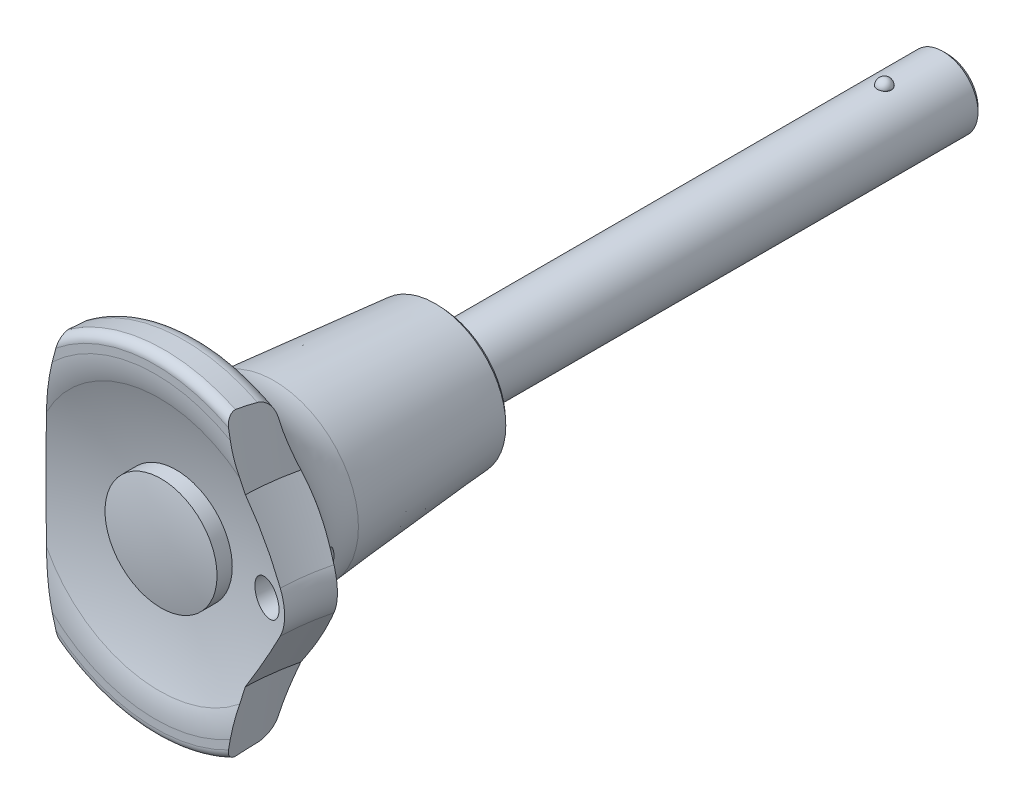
ISO-10303-21;
HEADER;
FILE_DESCRIPTION(('STEP AP214'),'2;1');
FILE_NAME('part.step','',(''),(''),'','','');
FILE_SCHEMA(('AUTOMOTIVE_DESIGN { 1 0 10303 214 1 1 1 1 }'));
ENDSEC;
DATA;
#1=APPLICATION_CONTEXT('core data for automotive mechanical design processes');
#2=APPLICATION_PROTOCOL_DEFINITION('international standard','automotive_design',2000,#1);
#3=PRODUCT_CONTEXT('',#1,'mechanical');
#4=PRODUCT('Part','Part','',(#3));
#5=PRODUCT_RELATED_PRODUCT_CATEGORY('part','',(#4));
#6=PRODUCT_DEFINITION_FORMATION('','',#4);
#7=PRODUCT_DEFINITION_CONTEXT('part definition',#1,'design');
#8=PRODUCT_DEFINITION('design','',#6,#7);
#9=PRODUCT_DEFINITION_SHAPE('','',#8);
#10=(LENGTH_UNIT() NAMED_UNIT(*) SI_UNIT(.MILLI.,.METRE.));
#11=(NAMED_UNIT(*) PLANE_ANGLE_UNIT() SI_UNIT($,.RADIAN.));
#12=(NAMED_UNIT(*) SI_UNIT($,.STERADIAN.) SOLID_ANGLE_UNIT());
#13=UNCERTAINTY_MEASURE_WITH_UNIT(LENGTH_MEASURE(1.E-05),#10,'distance_accuracy_value','');
#14=(GEOMETRIC_REPRESENTATION_CONTEXT(3) GLOBAL_UNCERTAINTY_ASSIGNED_CONTEXT((#13)) GLOBAL_UNIT_ASSIGNED_CONTEXT((#10,
#11,#12)) REPRESENTATION_CONTEXT('',''));
#15=CARTESIAN_POINT('',(0.,0.,0.));
#16=DIRECTION('',(0.,0.,1.));
#17=DIRECTION('',(1.,0.,0.));
#18=AXIS2_PLACEMENT_3D('',#15,#16,#17);
#19=CARTESIAN_POINT('',(0.,3.94833333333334,-50.8));
#20=DIRECTION('',(1.,0.,0.));
#21=DIRECTION('',(0.,1.,0.));
#22=AXIS2_PLACEMENT_3D('',#19,#20,#21);
#23=SPHERICAL_SURFACE('',#22,0.80166666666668);
#24=CARTESIAN_POINT('',(0.,3.99999999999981,-50.8000000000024));
#25=DIRECTION('',(0.,1.,-5.97983654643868E-13));
#26=DIRECTION('',(0.,5.97983654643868E-13,1.));
#27=AXIS2_PLACEMENT_3D('',#24,#25,#26);
#28=CIRCLE('',#27,0.8);
#29=CARTESIAN_POINT('',(0.,4.0000000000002,-50.0000000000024));
#30=VERTEX_POINT('',#29);
#31=CARTESIAN_POINT('',(0.,4.0000000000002,-51.6000000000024));
#32=VERTEX_POINT('',#31);
#33=EDGE_CURVE('E597',#30,#32,#28,.F.);
#34=ORIENTED_EDGE('',*,*,#33,.F.);
#35=CARTESIAN_POINT('',(0.,4.00000000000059,-50.8000000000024));
#36=DIRECTION('',(0.,1.,-5.97983654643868E-13));
#37=DIRECTION('',(0.,5.97983654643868E-13,1.));
#38=AXIS2_PLACEMENT_3D('',#35,#36,#37);
#39=CIRCLE('',#38,0.8);
#40=EDGE_CURVE('E594',#32,#30,#39,.F.);
#41=ORIENTED_EDGE('',*,*,#40,.F.);
#42=EDGE_LOOP('',(#34,#41));
#43=FACE_BOUND('',#42,.T.);
#44=ADVANCED_FACE('F14',(#43),#23,.T.);
#45=CARTESIAN_POINT('',(0.,-3.94833333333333,-50.8));
#46=DIRECTION('',(1.,0.,0.));
#47=DIRECTION('',(0.,1.,0.));
#48=AXIS2_PLACEMENT_3D('',#45,#46,#47);
#49=SPHERICAL_SURFACE('',#48,0.801666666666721);
#50=CARTESIAN_POINT('',(0.,-4.00000000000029,-50.7999999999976));
#51=DIRECTION('',(0.,1.,-5.97983654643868E-13));
#52=DIRECTION('',(0.,5.97983654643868E-13,1.));
#53=AXIS2_PLACEMENT_3D('',#50,#51,#52);
#54=CIRCLE('',#53,0.8);
#55=CARTESIAN_POINT('',(0.,-4.00000000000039,-51.5999999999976));
#56=VERTEX_POINT('',#55);
#57=CARTESIAN_POINT('',(0.,-4.00000000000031,-49.9999999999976));
#58=VERTEX_POINT('',#57);
#59=EDGE_CURVE('E29',#56,#58,#54,.T.);
#60=ORIENTED_EDGE('',*,*,#59,.F.);
#61=CARTESIAN_POINT('',(0.,-4.00000000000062,-50.7999999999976));
#62=DIRECTION('',(0.,1.,-5.97983654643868E-13));
#63=DIRECTION('',(0.,5.97983654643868E-13,1.));
#64=AXIS2_PLACEMENT_3D('',#61,#62,#63);
#65=CIRCLE('',#64,0.8);
#66=EDGE_CURVE('E586',#58,#56,#65,.T.);
#67=ORIENTED_EDGE('',*,*,#66,.F.);
#68=EDGE_LOOP('',(#60,#67));
#69=FACE_BOUND('',#68,.T.);
#70=ADVANCED_FACE('F565',(#69),#49,.T.);
#71=CARTESIAN_POINT('',(0.,-3.29514193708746E-13,-50.8));
#72=DIRECTION('',(0.,1.,-5.97983654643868E-13));
#73=DIRECTION('',(0.,5.97983654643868E-13,1.));
#74=AXIS2_PLACEMENT_3D('',#71,#72,#73);
#75=CYLINDRICAL_SURFACE('',#74,0.8);
#76=CARTESIAN_POINT('',(0.,-4.,-51.5999999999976));
#77=CARTESIAN_POINT('',(-0.0445375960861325,-4.00002795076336,-51.6000403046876));
#78=CARTESIAN_POINT('',(-0.089054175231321,-3.9992570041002,-51.5962833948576));
#79=CARTESIAN_POINT('',(-0.176745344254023,-3.9963262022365,-51.58148422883));
#80=CARTESIAN_POINT('',(-0.219921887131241,-3.99416847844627,-51.5704531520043));
#81=CARTESIAN_POINT('',(-0.303782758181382,-3.98867145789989,-51.5414110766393));
#82=CARTESIAN_POINT('',(-0.344466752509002,-3.98533200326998,-51.5233991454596));
#83=CARTESIAN_POINT('',(-0.422240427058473,-3.97784324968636,-51.4809370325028));
#84=CARTESIAN_POINT('',(-0.459329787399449,-3.97369387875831,-51.4564862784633));
#85=CARTESIAN_POINT('',(-0.529353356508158,-3.96497766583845,-51.4014906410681));
#86=CARTESIAN_POINT('',(-0.562232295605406,-3.96040640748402,-51.370876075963));
#87=CARTESIAN_POINT('',(-0.622426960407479,-3.95139379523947,-51.3045691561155));
#88=CARTESIAN_POINT('',(-0.649741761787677,-3.94695246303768,-51.2688759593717));
#89=CARTESIAN_POINT('',(-0.698266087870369,-3.93865943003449,-51.1930260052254));
#90=CARTESIAN_POINT('',(-0.71941792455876,-3.93481344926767,-51.1528316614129));
#91=CARTESIAN_POINT('',(-0.754645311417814,-3.92820998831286,-51.0693721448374));
#92=CARTESIAN_POINT('',(-0.768721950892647,-3.92545234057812,-51.0261074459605));
#93=CARTESIAN_POINT('',(-0.789220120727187,-3.92138246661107,-50.9383330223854));
#94=CARTESIAN_POINT('',(-0.795739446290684,-3.92005179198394,-50.8938470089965));
#95=CARTESIAN_POINT('',(-0.801241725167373,-3.91893099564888,-50.804393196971));
#96=CARTESIAN_POINT('',(-0.800225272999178,-3.91914075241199,-50.7594254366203));
#97=CARTESIAN_POINT('',(-0.790763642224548,-3.92106041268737,-50.671002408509));
#98=CARTESIAN_POINT('',(-0.782430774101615,-3.92274763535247,-50.6275345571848));
#99=CARTESIAN_POINT('',(-0.75875019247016,-3.92739639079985,-50.5426268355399));
#100=CARTESIAN_POINT('',(-0.743402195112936,-3.93035797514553,-50.5011870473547));
#101=CARTESIAN_POINT('',(-0.706019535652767,-3.93724500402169,-50.4211871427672));
#102=CARTESIAN_POINT('',(-0.683940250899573,-3.94117684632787,-50.382648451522));
#103=CARTESIAN_POINT('',(-0.63375390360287,-3.94955709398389,-50.3097822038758));
#104=CARTESIAN_POINT('',(-0.605646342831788,-3.95400554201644,-50.2754549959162));
#105=CARTESIAN_POINT('',(-0.543604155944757,-3.96301558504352,-50.2113406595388));
#106=CARTESIAN_POINT('',(-0.509574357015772,-3.96757778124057,-50.1816456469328));
#107=CARTESIAN_POINT('',(-0.436957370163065,-3.97622972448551,-50.1283630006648));
#108=CARTESIAN_POINT('',(-0.398368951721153,-3.98031934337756,-50.1047770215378));
#109=CARTESIAN_POINT('',(-0.317622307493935,-3.98757602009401,-50.0643643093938));
#110=CARTESIAN_POINT('',(-0.275456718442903,-3.99074111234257,-50.0475519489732));
#111=CARTESIAN_POINT('',(-0.18884949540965,-3.99577375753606,-50.0212982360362));
#112=CARTESIAN_POINT('',(-0.144411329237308,-3.99764322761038,-50.0118459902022));
#113=CARTESIAN_POINT('',(-0.0830150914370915,-3.99917303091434,-50.0041437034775));
#114=CARTESIAN_POINT('',(-0.0664370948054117,-3.99948283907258,-50.0025892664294));
#115=CARTESIAN_POINT('',(-0.0332418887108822,-3.99989614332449,-50.0005187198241));
#116=CARTESIAN_POINT('',(-0.0166247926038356,-3.99999998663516,-50.0000008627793));
#117=CARTESIAN_POINT('',(0.,-4.,-49.9999999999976));
#118=B_SPLINE_CURVE_WITH_KNOTS('',3,(#76,#77,#78,#79,#80,#81,#82,#83,#84,#85,#86,#87,#88,#89,
#90,#91,#92,#93,#94,#95,#96,#97,#98,#99,#100,#101,#102,#103,#104,#105,#106,#107,#108,#109,#110,
#111,#112,#113,#114,#115,#116,#117),.UNSPECIFIED.,.F.,.F.,(4,2,2,2,2,2,2,2,2,2,2,2,2,2,2,2,2,2,
2,2,4),(0.,0.133416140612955,0.266627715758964,0.399857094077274,0.533098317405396,
0.667940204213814,0.802804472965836,0.938893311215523,1.07496119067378,1.2092479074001,
1.34352402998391,1.47577429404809,1.60802990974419,1.74118206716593,1.8743452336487,
2.00988854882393,2.14546853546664,2.28133470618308,2.41699940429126,2.4669343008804,
2.5167849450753),.UNSPECIFIED.);
#119=EDGE_CURVE('E577',#56,#58,#118,.T.);
#120=ORIENTED_EDGE('',*,*,#119,.F.);
#121=ORIENTED_EDGE('',*,*,#59,.T.);
#122=EDGE_LOOP('',(#120,#121));
#123=FACE_BOUND('',#122,.T.);
#124=ADVANCED_FACE('F568',(#123),#75,.T.);
#125=CARTESIAN_POINT('',(0.,-3.29514193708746E-13,-50.8));
#126=DIRECTION('',(0.,1.,-5.97983654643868E-13));
#127=DIRECTION('',(0.,5.97983654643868E-13,1.));
#128=AXIS2_PLACEMENT_3D('',#125,#126,#127);
#129=CYLINDRICAL_SURFACE('',#128,0.8);
#130=CARTESIAN_POINT('',(0.,4.,-50.0000000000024));
#131=CARTESIAN_POINT('',(-0.0445375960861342,4.00002795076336,-49.9999596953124));
#132=CARTESIAN_POINT('',(-0.0890541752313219,3.9992570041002,-50.0037166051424));
#133=CARTESIAN_POINT('',(-0.176745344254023,3.9963262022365,-50.01851577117));
#134=CARTESIAN_POINT('',(-0.21992188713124,3.99416847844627,-50.0295468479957));
#135=CARTESIAN_POINT('',(-0.303782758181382,3.98867145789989,-50.0585889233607));
#136=CARTESIAN_POINT('',(-0.344466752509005,3.98533200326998,-50.0766008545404));
#137=CARTESIAN_POINT('',(-0.422240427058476,3.97784324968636,-50.1190629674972));
#138=CARTESIAN_POINT('',(-0.459329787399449,3.97369387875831,-50.1435137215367));
#139=CARTESIAN_POINT('',(-0.529353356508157,3.96497766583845,-50.1985093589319));
#140=CARTESIAN_POINT('',(-0.562232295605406,3.96040640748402,-50.229123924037));
#141=CARTESIAN_POINT('',(-0.62242696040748,3.95139379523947,-50.2954308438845));
#142=CARTESIAN_POINT('',(-0.649741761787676,3.94695246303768,-50.3311240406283));
#143=CARTESIAN_POINT('',(-0.698266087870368,3.93865943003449,-50.4069739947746));
#144=CARTESIAN_POINT('',(-0.719417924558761,3.93481344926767,-50.4471683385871));
#145=CARTESIAN_POINT('',(-0.754645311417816,3.92820998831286,-50.5306278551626));
#146=CARTESIAN_POINT('',(-0.768721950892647,3.92545234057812,-50.5738925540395));
#147=CARTESIAN_POINT('',(-0.789220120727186,3.92138246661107,-50.6616669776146));
#148=CARTESIAN_POINT('',(-0.795739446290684,3.92005179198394,-50.7061529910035));
#149=CARTESIAN_POINT('',(-0.801241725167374,3.91893099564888,-50.795606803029));
#150=CARTESIAN_POINT('',(-0.800225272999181,3.91914075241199,-50.8405745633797));
#151=CARTESIAN_POINT('',(-0.790763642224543,3.92106041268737,-50.928997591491));
#152=CARTESIAN_POINT('',(-0.782430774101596,3.92274763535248,-50.9724654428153));
#153=CARTESIAN_POINT('',(-0.758750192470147,3.92739639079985,-51.0573731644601));
#154=CARTESIAN_POINT('',(-0.743402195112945,3.93035797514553,-51.0988129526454));
#155=CARTESIAN_POINT('',(-0.706019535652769,3.93724500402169,-51.1788128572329));
#156=CARTESIAN_POINT('',(-0.683940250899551,3.94117684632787,-51.2173515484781));
#157=CARTESIAN_POINT('',(-0.633753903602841,3.9495570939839,-51.2902177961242));
#158=CARTESIAN_POINT('',(-0.605646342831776,3.95400554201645,-51.3245450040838));
#159=CARTESIAN_POINT('',(-0.54360415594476,3.96301558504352,-51.3886593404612));
#160=CARTESIAN_POINT('',(-0.50957435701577,3.96757778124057,-51.4183543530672));
#161=CARTESIAN_POINT('',(-0.436957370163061,3.97622972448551,-51.4716369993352));
#162=CARTESIAN_POINT('',(-0.398368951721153,3.98031934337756,-51.4952229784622));
#163=CARTESIAN_POINT('',(-0.317622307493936,3.98757602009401,-51.5356356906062));
#164=CARTESIAN_POINT('',(-0.2754567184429,3.99074111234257,-51.5524480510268));
#165=CARTESIAN_POINT('',(-0.188849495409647,3.99577375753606,-51.5787017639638));
#166=CARTESIAN_POINT('',(-0.144411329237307,3.99764322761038,-51.5881540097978));
#167=CARTESIAN_POINT('',(-0.0830150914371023,3.99917303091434,-51.5958562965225));
#168=CARTESIAN_POINT('',(-0.0664370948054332,3.99948283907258,-51.5974107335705));
#169=CARTESIAN_POINT('',(-0.0332418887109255,3.99989614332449,-51.5994812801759));
#170=CARTESIAN_POINT('',(-0.0166247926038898,3.99999998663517,-51.5999991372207));
#171=CARTESIAN_POINT('',(0.,4.,-51.6000000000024));
#172=B_SPLINE_CURVE_WITH_KNOTS('',3,(#130,#131,#132,#133,#134,#135,#136,#137,#138,#139,#140,
#141,#142,#143,#144,#145,#146,#147,#148,#149,#150,#151,#152,#153,#154,#155,#156,#157,#158,#159,
#160,#161,#162,#163,#164,#165,#166,#167,#168,#169,#170,#171),.UNSPECIFIED.,.F.,.F.,(4,2,2,2,2,2,
2,2,2,2,2,2,2,2,2,2,2,2,2,2,4),(0.,0.133416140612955,0.266627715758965,0.399857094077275,
0.533098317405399,0.667940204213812,0.802804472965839,0.93889331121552,1.07496119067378,
1.20924790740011,1.34352402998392,1.47577429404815,1.60802990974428,1.74118206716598,
1.87434523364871,2.00988854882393,2.14546853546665,2.28133470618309,2.41699940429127,
2.46693430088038,2.51678494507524),.UNSPECIFIED.);
#173=EDGE_CURVE('E585',#30,#32,#172,.T.);
#174=ORIENTED_EDGE('',*,*,#173,.F.);
#175=ORIENTED_EDGE('',*,*,#33,.T.);
#176=EDGE_LOOP('',(#174,#175));
#177=FACE_BOUND('',#176,.T.);
#178=ADVANCED_FACE('F572',(#177),#129,.T.);
#179=CARTESIAN_POINT('',(0.,1.75,-58.));
#180=DIRECTION('',(0.,0.,-1.));
#181=DIRECTION('',(-1.,0.,0.));
#182=AXIS2_PLACEMENT_3D('',#179,#180,#181);
#183=PLANE('',#182);
#184=CARTESIAN_POINT('',(0.,0.,-57.9999999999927));
#185=DIRECTION('',(0.,0.,1.));
#186=DIRECTION('',(1.,0.,0.));
#187=AXIS2_PLACEMENT_3D('',#184,#185,#186);
#188=CIRCLE('',#187,3.49999999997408);
#189=CARTESIAN_POINT('',(3.49999999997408,0.,-57.9999999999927));
#190=VERTEX_POINT('',#189);
#191=EDGE_CURVE('E609',#190,#190,#188,.T.);
#192=ORIENTED_EDGE('',*,*,#191,.F.);
#193=EDGE_LOOP('',(#192));
#194=FACE_BOUND('',#193,.T.);
#195=ADVANCED_FACE('F646',(#194),#183,.T.);
#196=CARTESIAN_POINT('',(0.,-3.29514193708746E-13,-50.8));
#197=DIRECTION('',(0.,1.,-5.97983654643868E-13));
#198=DIRECTION('',(0.,5.97983654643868E-13,1.));
#199=AXIS2_PLACEMENT_3D('',#196,#197,#198);
#200=CYLINDRICAL_SURFACE('',#199,0.8);
#201=CARTESIAN_POINT('',(0.,4.00000000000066,-51.6000000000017));
#202=CARTESIAN_POINT('',(0.0445375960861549,4.0000279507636,-51.6000403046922));
#203=CARTESIAN_POINT('',(0.0890541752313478,3.99925700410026,-51.5962833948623));
#204=CARTESIAN_POINT('',(0.176745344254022,3.99632620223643,-51.5814842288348));
#205=CARTESIAN_POINT('',(0.219921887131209,3.99416847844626,-51.5704531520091));
#206=CARTESIAN_POINT('',(0.303782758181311,3.98867145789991,-51.5414110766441));
#207=CARTESIAN_POINT('',(0.344466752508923,3.98533200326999,-51.5233991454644));
#208=CARTESIAN_POINT('',(0.422240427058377,3.97784324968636,-51.4809370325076));
#209=CARTESIAN_POINT('',(0.459329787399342,3.97369387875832,-51.4564862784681));
#210=CARTESIAN_POINT('',(0.529353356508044,3.96497766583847,-51.4014906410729));
#211=CARTESIAN_POINT('',(0.562232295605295,3.96040640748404,-51.3708760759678));
#212=CARTESIAN_POINT('',(0.622426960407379,3.95139379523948,-51.3045691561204));
#213=CARTESIAN_POINT('',(0.649741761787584,3.9469524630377,-51.2688759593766));
#214=CARTESIAN_POINT('',(0.698266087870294,3.9386594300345,-51.1930260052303));
#215=CARTESIAN_POINT('',(0.719417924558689,3.93481344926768,-51.1528316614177));
#216=CARTESIAN_POINT('',(0.754645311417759,3.92820998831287,-51.0693721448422));
#217=CARTESIAN_POINT('',(0.768721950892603,3.92545234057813,-51.0261074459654));
#218=CARTESIAN_POINT('',(0.789220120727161,3.92138246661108,-50.9383330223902));
#219=CARTESIAN_POINT('',(0.79573944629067,3.92005179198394,-50.8938470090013));
#220=CARTESIAN_POINT('',(0.801241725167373,3.91893099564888,-50.8043931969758));
#221=CARTESIAN_POINT('',(0.800225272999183,3.91914075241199,-50.7594254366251));
#222=CARTESIAN_POINT('',(0.79076364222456,3.92106041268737,-50.6710024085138));
#223=CARTESIAN_POINT('',(0.782430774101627,3.92274763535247,-50.6275345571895));
#224=CARTESIAN_POINT('',(0.75875019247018,3.92739639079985,-50.5426268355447));
#225=CARTESIAN_POINT('',(0.743402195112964,3.93035797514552,-50.5011870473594));
#226=CARTESIAN_POINT('',(0.706019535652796,3.93724500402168,-50.4211871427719));
#227=CARTESIAN_POINT('',(0.683940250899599,3.94117684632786,-50.3826484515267));
#228=CARTESIAN_POINT('',(0.6337539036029,3.94955709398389,-50.3097822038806));
#229=CARTESIAN_POINT('',(0.605646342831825,3.95400554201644,-50.275454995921));
#230=CARTESIAN_POINT('',(0.543604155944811,3.96301558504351,-50.2113406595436));
#231=CARTESIAN_POINT('',(0.509574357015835,3.96757778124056,-50.1816456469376));
#232=CARTESIAN_POINT('',(0.436957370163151,3.9762297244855,-50.1283630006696));
#233=CARTESIAN_POINT('',(0.398368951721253,3.98031934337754,-50.1047770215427));
#234=CARTESIAN_POINT('',(0.317622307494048,3.987576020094,-50.0643643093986));
#235=CARTESIAN_POINT('',(0.275456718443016,3.99074111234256,-50.047551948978));
#236=CARTESIAN_POINT('',(0.18884949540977,3.99577375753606,-50.021298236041));
#237=CARTESIAN_POINT('',(0.144411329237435,3.99764322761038,-50.011845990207));
#238=CARTESIAN_POINT('',(0.0830150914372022,3.99917303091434,-50.0041437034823));
#239=CARTESIAN_POINT('',(0.0664370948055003,3.99948283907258,-50.0025892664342));
#240=CARTESIAN_POINT('',(0.0332418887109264,3.99989614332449,-50.0005187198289));
#241=CARTESIAN_POINT('',(0.0166247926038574,3.99999998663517,-50.0000008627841));
#242=CARTESIAN_POINT('',(0.,4.,-50.0000000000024));
#243=B_SPLINE_CURVE_WITH_KNOTS('',3,(#201,#202,#203,#204,#205,#206,#207,#208,#209,#210,#211,
#212,#213,#214,#215,#216,#217,#218,#219,#220,#221,#222,#223,#224,#225,#226,#227,#228,#229,#230,
#231,#232,#233,#234,#235,#236,#237,#238,#239,#240,#241,#242),.UNSPECIFIED.,.F.,.F.,(4,2,2,2,2,2,
2,2,2,2,2,2,2,2,2,2,2,2,2,2,4),(0.,0.133416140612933,0.266627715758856,0.399857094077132,
0.533098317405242,0.667940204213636,0.802804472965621,0.938893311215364,1.07496119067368,
1.2092479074,1.34352402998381,1.47577429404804,1.60802990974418,1.74118206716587,
1.8743452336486,2.00988854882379,2.14546853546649,2.28133470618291,2.41699940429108,
2.46693430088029,2.51678494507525),.UNSPECIFIED.);
#244=EDGE_CURVE('E606',#32,#30,#243,.T.);
#245=ORIENTED_EDGE('',*,*,#244,.F.);
#246=ORIENTED_EDGE('',*,*,#40,.T.);
#247=EDGE_LOOP('',(#245,#246));
#248=FACE_BOUND('',#247,.T.);
#249=ADVANCED_FACE('F624',(#248),#200,.T.);
#250=CARTESIAN_POINT('',(0.,-3.29514193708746E-13,-50.8));
#251=DIRECTION('',(0.,1.,-5.97983654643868E-13));
#252=DIRECTION('',(0.,5.97983654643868E-13,1.));
#253=AXIS2_PLACEMENT_3D('',#250,#251,#252);
#254=CYLINDRICAL_SURFACE('',#253,0.8);
#255=CARTESIAN_POINT('',(0.,-4.,-49.9999999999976));
#256=CARTESIAN_POINT('',(0.044537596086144,-4.00002795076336,-49.9999596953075));
#257=CARTESIAN_POINT('',(0.0890541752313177,-3.9992570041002,-50.0037166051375));
#258=CARTESIAN_POINT('',(0.176745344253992,-3.9963262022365,-50.0185157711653));
#259=CARTESIAN_POINT('',(0.219921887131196,-3.99416847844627,-50.029546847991));
#260=CARTESIAN_POINT('',(0.303782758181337,-3.9886714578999,-50.058588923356));
#261=CARTESIAN_POINT('',(0.344466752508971,-3.98533200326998,-50.0766008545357));
#262=CARTESIAN_POINT('',(0.422240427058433,-3.97784324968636,-50.1190629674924));
#263=CARTESIAN_POINT('',(0.459329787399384,-3.97369387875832,-50.1435137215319));
#264=CARTESIAN_POINT('',(0.529353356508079,-3.96497766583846,-50.1985093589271));
#265=CARTESIAN_POINT('',(0.562232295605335,-3.96040640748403,-50.2291239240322));
#266=CARTESIAN_POINT('',(0.622426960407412,-3.95139379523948,-50.2954308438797));
#267=CARTESIAN_POINT('',(0.649741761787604,-3.94695246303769,-50.3311240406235));
#268=CARTESIAN_POINT('',(0.698266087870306,-3.93865943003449,-50.4069739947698));
#269=CARTESIAN_POINT('',(0.719417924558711,-3.93481344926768,-50.4471683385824));
#270=CARTESIAN_POINT('',(0.754645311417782,-3.92820998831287,-50.5306278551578));
#271=CARTESIAN_POINT('',(0.768721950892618,-3.92545234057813,-50.5738925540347));
#272=CARTESIAN_POINT('',(0.789220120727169,-3.92138246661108,-50.6616669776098));
#273=CARTESIAN_POINT('',(0.795739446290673,-3.92005179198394,-50.7061529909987));
#274=CARTESIAN_POINT('',(0.801241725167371,-3.91893099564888,-50.7956068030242));
#275=CARTESIAN_POINT('',(0.800225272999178,-3.91914075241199,-50.8405745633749));
#276=CARTESIAN_POINT('',(0.790763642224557,-3.92106041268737,-50.9289975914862));
#277=CARTESIAN_POINT('',(0.782430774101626,-3.92274763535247,-50.9724654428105));
#278=CARTESIAN_POINT('',(0.758750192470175,-3.92739639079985,-51.0573731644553));
#279=CARTESIAN_POINT('',(0.743402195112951,-3.93035797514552,-51.0988129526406));
#280=CARTESIAN_POINT('',(0.706019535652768,-3.93724500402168,-51.1788128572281));
#281=CARTESIAN_POINT('',(0.683940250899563,-3.94117684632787,-51.2173515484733));
#282=CARTESIAN_POINT('',(0.633753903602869,-3.94955709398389,-51.2902177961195));
#283=CARTESIAN_POINT('',(0.605646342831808,-3.95400554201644,-51.3245450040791));
#284=CARTESIAN_POINT('',(0.543604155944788,-3.96301558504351,-51.3886593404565));
#285=CARTESIAN_POINT('',(0.509574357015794,-3.96757778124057,-51.4183543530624));
#286=CARTESIAN_POINT('',(0.436957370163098,-3.97622972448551,-51.4716369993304));
#287=CARTESIAN_POINT('',(0.398368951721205,-3.98031934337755,-51.4952229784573));
#288=CARTESIAN_POINT('',(0.317622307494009,-3.987576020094,-51.5356356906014));
#289=CARTESIAN_POINT('',(0.275456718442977,-3.99074111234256,-51.552448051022));
#290=CARTESIAN_POINT('',(0.188849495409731,-3.99577375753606,-51.578701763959));
#291=CARTESIAN_POINT('',(0.144411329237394,-3.99764322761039,-51.588154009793));
#292=CARTESIAN_POINT('',(0.0830150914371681,-3.99917303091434,-51.5958562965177));
#293=CARTESIAN_POINT('',(0.0664370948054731,-3.99948283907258,-51.5974107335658));
#294=CARTESIAN_POINT('',(0.0332418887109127,-3.99989614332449,-51.5994812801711));
#295=CARTESIAN_POINT('',(0.0166247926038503,-3.99999998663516,-51.5999991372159));
#296=CARTESIAN_POINT('',(0.,-4.,-51.5999999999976));
#297=B_SPLINE_CURVE_WITH_KNOTS('',3,(#255,#256,#257,#258,#259,#260,#261,#262,#263,#264,#265,
#266,#267,#268,#269,#270,#271,#272,#273,#274,#275,#276,#277,#278,#279,#280,#281,#282,#283,#284,
#285,#286,#287,#288,#289,#290,#291,#292,#293,#294,#295,#296),.UNSPECIFIED.,.F.,.F.,(4,2,2,2,2,2,
2,2,2,2,2,2,2,2,2,2,2,2,2,2,4),(0.,0.133416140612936,0.266627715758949,0.399857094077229,
0.533098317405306,0.667940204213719,0.802804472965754,0.938893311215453,1.07496119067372,
1.20924790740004,1.34352402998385,1.47577429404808,1.60802990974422,1.74118206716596,
1.87434523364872,2.00988854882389,2.14546853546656,2.28133470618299,2.41699940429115,
2.46693430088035,2.51678494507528),.UNSPECIFIED.);
#298=EDGE_CURVE('E603',#58,#56,#297,.T.);
#299=ORIENTED_EDGE('',*,*,#298,.F.);
#300=ORIENTED_EDGE('',*,*,#66,.T.);
#301=EDGE_LOOP('',(#299,#300));
#302=FACE_BOUND('',#301,.T.);
#303=ADVANCED_FACE('F605',(#302),#254,.T.);
#304=CARTESIAN_POINT('',(0.,0.,-57.5000000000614));
#305=DIRECTION('',(0.,0.,1.));
#306=DIRECTION('',(1.,0.,0.));
#307=AXIS2_PLACEMENT_3D('',#304,#305,#306);
#308=CONICAL_SURFACE('',#307,3.99999999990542,0.785398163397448);
#309=ORIENTED_EDGE('',*,*,#191,.T.);
#310=EDGE_LOOP('',(#309));
#311=FACE_BOUND('',#310,.T.);
#312=CARTESIAN_POINT('',(0.,0.,-57.5));
#313=DIRECTION('',(0.,0.,1.));
#314=DIRECTION('',(1.,0.,0.));
#315=AXIS2_PLACEMENT_3D('',#312,#313,#314);
#316=CIRCLE('',#315,4.);
#317=CARTESIAN_POINT('',(4.,0.,-57.5));
#318=VERTEX_POINT('',#317);
#319=EDGE_CURVE('E24',#318,#318,#316,.T.);
#320=ORIENTED_EDGE('',*,*,#319,.F.);
#321=EDGE_LOOP('',(#320));
#322=FACE_BOUND('',#321,.T.);
#323=ADVANCED_FACE('F623',(#311,#322),#308,.T.);
#324=CARTESIAN_POINT('',(0.,0.,-20.625));
#325=DIRECTION('',(0.,0.,1.));
#326=DIRECTION('',(1.,0.,0.));
#327=AXIS2_PLACEMENT_3D('',#324,#325,#326);
#328=CYLINDRICAL_SURFACE('',#327,4.);
#329=CARTESIAN_POINT('',(0.,0.,0.));
#330=DIRECTION('',(0.,0.,-1.));
#331=DIRECTION('',(-1.,0.,0.));
#332=AXIS2_PLACEMENT_3D('',#329,#330,#331);
#333=CIRCLE('',#332,4.);
#334=CARTESIAN_POINT('',(-4.,0.,0.));
#335=VERTEX_POINT('',#334);
#336=EDGE_CURVE('E9',#335,#335,#333,.F.);
#337=ORIENTED_EDGE('',*,*,#336,.F.);
#338=EDGE_LOOP('',(#337));
#339=FACE_BOUND('',#338,.T.);
#340=ORIENTED_EDGE('',*,*,#173,.T.);
#341=ORIENTED_EDGE('',*,*,#244,.T.);
#342=EDGE_LOOP('',(#340,#341));
#343=FACE_BOUND('',#342,.T.);
#344=ORIENTED_EDGE('',*,*,#119,.T.);
#345=ORIENTED_EDGE('',*,*,#298,.T.);
#346=EDGE_LOOP('',(#344,#345));
#347=FACE_BOUND('',#346,.T.);
#348=ORIENTED_EDGE('',*,*,#319,.T.);
#349=EDGE_LOOP('',(#348));
#350=FACE_BOUND('',#349,.T.);
#351=ADVANCED_FACE('F16',(#339,#343,#347,#350),#328,.T.);
#352=CARTESIAN_POINT('',(0.,1.03504969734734E-13,0.667307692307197));
#353=DIRECTION('',(1.,0.,0.));
#354=DIRECTION('',(0.,1.,0.));
#355=AXIS2_PLACEMENT_3D('',#352,#353,#354);
#356=SPHERICAL_SURFACE('',#355,31.8326923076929);
#357=CARTESIAN_POINT('',(0.,0.,31.85));
#358=DIRECTION('',(0.,0.,1.));
#359=DIRECTION('',(1.,0.,0.));
#360=AXIS2_PLACEMENT_3D('',#357,#358,#359);
#361=CIRCLE('',#360,6.4);
#362=CARTESIAN_POINT('',(6.4,0.,31.85));
#363=VERTEX_POINT('',#362);
#364=EDGE_CURVE('E536',#363,#363,#361,.F.);
#365=ORIENTED_EDGE('',*,*,#364,.F.);
#366=EDGE_LOOP('',(#365));
#367=FACE_BOUND('',#366,.T.);
#368=ADVANCED_FACE('F541',(#367),#356,.T.);
#369=CARTESIAN_POINT('',(0.,0.,24.05));
#370=DIRECTION('',(0.,0.,1.));
#371=DIRECTION('',(1.,0.,0.));
#372=AXIS2_PLACEMENT_3D('',#369,#370,#371);
#373=CYLINDRICAL_SURFACE('',#372,6.4);
#374=ORIENTED_EDGE('',*,*,#364,.T.);
#375=EDGE_LOOP('',(#374));
#376=FACE_BOUND('',#375,.T.);
#377=CARTESIAN_POINT('',(6.4,0.,30.1110590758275));
#378=CARTESIAN_POINT('',(6.40000129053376,-0.179810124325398,30.111059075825));
#379=CARTESIAN_POINT('',(6.39241914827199,-0.359599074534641,30.1110590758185));
#380=CARTESIAN_POINT('',(6.3621435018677,-0.71795909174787,30.1110590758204));
#381=CARTESIAN_POINT('',(6.33944602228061,-0.896529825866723,30.1110590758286));
#382=CARTESIAN_POINT('',(6.2790684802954,-1.25128110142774,30.1110590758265));
#383=CARTESIAN_POINT('',(6.24137507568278,-1.42745936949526,30.1110590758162));
#384=CARTESIAN_POINT('',(6.15125799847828,-1.77607703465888,30.1110590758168));
#385=CARTESIAN_POINT('',(6.09882894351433,-1.94851504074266,30.1110590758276));
#386=CARTESIAN_POINT('',(5.9796699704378,-2.2882129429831,30.1110590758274));
#387=CARTESIAN_POINT('',(5.91295217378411,-2.45547709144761,30.1110590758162));
#388=CARTESIAN_POINT('',(5.76563661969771,-2.7838514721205,30.1110590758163));
#389=CARTESIAN_POINT('',(5.68503375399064,-2.9449594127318,30.1110590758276));
#390=CARTESIAN_POINT('',(5.51059240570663,-3.25971260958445,30.1110590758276));
#391=CARTESIAN_POINT('',(5.4167621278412,-3.41336241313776,30.1110590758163));
#392=CARTESIAN_POINT('',(5.21645805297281,-3.71226938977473,30.1110590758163));
#393=CARTESIAN_POINT('',(5.10997960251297,-3.85752344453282,30.1110590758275));
#394=CARTESIAN_POINT('',(4.88519374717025,-4.13850742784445,30.1110590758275));
#395=CARTESIAN_POINT('',(4.76688947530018,-4.27423986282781,30.1110590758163));
#396=CARTESIAN_POINT('',(4.51922341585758,-4.53530651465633,30.1110590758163));
#397=CARTESIAN_POINT('',(4.38985756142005,-4.66063687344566,30.1110590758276));
#398=CARTESIAN_POINT('',(4.12107041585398,-4.89991253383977,30.1110590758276));
#399=CARTESIAN_POINT('',(3.98165245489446,-5.01386157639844,30.1110590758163));
#400=CARTESIAN_POINT('',(3.69366097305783,-5.22965167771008,30.1110590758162));
#401=CARTESIAN_POINT('',(3.54508409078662,-5.33148825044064,30.1110590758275));
#402=CARTESIAN_POINT('',(3.23993719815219,-5.52224318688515,30.1110590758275));
#403=CARTESIAN_POINT('',(3.08337030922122,-5.61116654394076,30.1110590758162));
#404=CARTESIAN_POINT('',(2.76324420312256,-5.77554056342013,30.1110590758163));
#405=CARTESIAN_POINT('',(2.59968242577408,-5.85098623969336,30.1110590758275));
#406=CARTESIAN_POINT('',(2.2668445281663,-5.98780235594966,30.1110590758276));
#407=CARTESIAN_POINT('',(2.0975705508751,-6.04917800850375,30.1110590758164));
#408=CARTESIAN_POINT('',(1.75439473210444,-6.15747441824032,30.1110590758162));
#409=CARTESIAN_POINT('',(1.58049120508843,-6.20438983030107,30.1110590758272));
#410=CARTESIAN_POINT('',(1.22940084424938,-6.283384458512,30.1110590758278));
#411=CARTESIAN_POINT('',(1.05221523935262,-6.31546911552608,30.1110590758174));
#412=CARTESIAN_POINT('',(0.695754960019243,-6.36461764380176,30.1110590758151));
#413=CARTESIAN_POINT('',(0.516479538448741,-6.38167596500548,30.1110590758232));
#414=CARTESIAN_POINT('',(-0.0224375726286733,-6.41003711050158,30.1110590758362));
#415=CARTESIAN_POINT('',(-0.383552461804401,-6.39861178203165,30.1110590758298));
#416=CARTESIAN_POINT('',(-1.09854136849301,-6.31529390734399,30.1110590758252));
#417=CARTESIAN_POINT('',(-1.45241538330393,-6.24340133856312,30.1110590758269));
#418=CARTESIAN_POINT('',(-2.14312422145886,-6.04122706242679,30.1110590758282));
#419=CARTESIAN_POINT('',(-2.47995902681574,-5.91094529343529,30.1110590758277));
#420=CARTESIAN_POINT('',(-3.12696102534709,-5.59568095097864,30.1110590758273));
#421=CARTESIAN_POINT('',(-3.43712822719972,-5.41069839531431,30.1110590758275));
#422=CARTESIAN_POINT('',(-4.02200801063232,-4.99128634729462,30.1110590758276));
#423=CARTESIAN_POINT('',(-4.29672060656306,-4.75685687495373,30.1110590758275));
#424=CARTESIAN_POINT('',(-4.80288833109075,-4.24520495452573,30.1110590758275));
#425=CARTESIAN_POINT('',(-5.03434345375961,-3.96798250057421,30.1110590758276));
#426=CARTESIAN_POINT('',(-5.4474271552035,-3.37861432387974,30.1110590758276));
#427=CARTESIAN_POINT('',(-5.62905572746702,-3.06646859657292,30.1110590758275));
#428=CARTESIAN_POINT('',(-5.9373300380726,-2.41611476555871,30.1110590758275));
#429=CARTESIAN_POINT('',(-6.06397577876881,-2.0779066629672,30.1110590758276));
#430=CARTESIAN_POINT('',(-6.25868942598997,-1.38502883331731,30.1110590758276));
#431=CARTESIAN_POINT('',(-6.32675733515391,-1.03035910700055,30.1110590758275));
#432=CARTESIAN_POINT('',(-6.40238305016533,-0.314626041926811,30.1110590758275));
#433=CARTESIAN_POINT('',(-6.4099408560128,0.0464372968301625,30.1110590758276));
#434=CARTESIAN_POINT('',(-6.36433185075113,0.764708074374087,30.1110590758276));
#435=CARTESIAN_POINT('',(-6.31116503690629,1.12191551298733,30.1110590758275));
#436=CARTESIAN_POINT('',(-6.14561593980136,1.82233442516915,30.1110590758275));
#437=CARTESIAN_POINT('',(-6.0332336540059,2.16554589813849,30.1110590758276));
#438=CARTESIAN_POINT('',(-5.75244417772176,2.82823003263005,30.1110590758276));
#439=CARTESIAN_POINT('',(-5.58403699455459,3.14770269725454,30.1110590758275));
#440=CARTESIAN_POINT('',(-5.19597704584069,3.75384041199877,30.1110590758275));
#441=CARTESIAN_POINT('',(-4.97632428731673,4.04050546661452,30.1110590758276));
#442=CARTESIAN_POINT('',(-4.49201316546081,4.57289025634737,30.1110590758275));
#443=CARTESIAN_POINT('',(-4.22735478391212,4.81860997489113,30.1110590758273));
#444=CARTESIAN_POINT('',(-3.66052736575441,5.26212983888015,30.1110590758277));
#445=CARTESIAN_POINT('',(-3.35835831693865,5.45992996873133,30.1110590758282));
#446=CARTESIAN_POINT('',(-2.72515445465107,5.80199137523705,30.111059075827));
#447=CARTESIAN_POINT('',(-2.39411967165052,5.94625270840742,30.1110590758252));
#448=CARTESIAN_POINT('',(-1.71233203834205,6.17715664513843,30.1110590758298));
#449=CARTESIAN_POINT('',(-1.3615791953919,6.26379927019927,30.1110590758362));
#450=CARTESIAN_POINT('',(-0.828635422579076,6.34869298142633,30.1110590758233));
#451=CARTESIAN_POINT('',(-0.649753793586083,6.36947821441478,30.1110590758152));
#452=CARTESIAN_POINT('',(-0.29089341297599,6.3959118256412,30.1110590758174));
#453=CARTESIAN_POINT('',(-0.110915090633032,6.40156578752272,30.1110590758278));
#454=CARTESIAN_POINT('',(0.248931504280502,6.39769010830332,30.1110590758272));
#455=CARTESIAN_POINT('',(0.42879971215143,6.38815488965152,30.1110590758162));
#456=CARTESIAN_POINT('',(0.787030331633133,6.35397041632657,30.1110590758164));
#457=CARTESIAN_POINT('',(0.965393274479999,6.32932674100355,30.1110590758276));
#458=CARTESIAN_POINT('',(1.31947460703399,6.2650918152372,30.1110590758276));
#459=CARTESIAN_POINT('',(1.49519199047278,6.22549501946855,30.1110590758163));
#460=CARTESIAN_POINT('',(1.84260157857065,6.13165408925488,30.1110590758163));
#461=CARTESIAN_POINT('',(2.01429524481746,6.07741536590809,30.1110590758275));
#462=CARTESIAN_POINT('',(2.35256975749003,5.95464555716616,30.1110590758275));
#463=CARTESIAN_POINT('',(2.51914859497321,5.88610893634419,30.1110590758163));
#464=CARTESIAN_POINT('',(2.84587864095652,5.73527147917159,30.1110590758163));
#465=CARTESIAN_POINT('',(3.00603219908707,5.65297573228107,30.1110590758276));
#466=CARTESIAN_POINT('',(3.31889024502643,5.47515780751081,30.1110590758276));
#467=CARTESIAN_POINT('',(3.47159225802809,5.37963127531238,30.1110590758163));
#468=CARTESIAN_POINT('',(3.76834973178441,5.17608944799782,30.1110590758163));
#469=CARTESIAN_POINT('',(3.91240836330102,5.06807877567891,30.1110590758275));
#470=CARTESIAN_POINT('',(4.19095341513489,4.84027769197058,30.1110590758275));
#471=CARTESIAN_POINT('',(4.32543729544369,4.72048417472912,30.1110590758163));
#472=CARTESIAN_POINT('',(4.58378691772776,4.47003941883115,30.1110590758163));
#473=CARTESIAN_POINT('',(4.70765655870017,4.33939220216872,30.1110590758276));
#474=CARTESIAN_POINT('',(4.94402627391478,4.0680460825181,30.1110590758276));
#475=CARTESIAN_POINT('',(5.05651927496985,3.92734101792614,30.1110590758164));
#476=CARTESIAN_POINT('',(5.26920889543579,3.63700546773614,30.1110590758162));
#477=CARTESIAN_POINT('',(5.36941003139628,3.48737829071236,30.1110590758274));
#478=CARTESIAN_POINT('',(5.55693134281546,3.18008480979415,30.1110590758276));
#479=CARTESIAN_POINT('',(5.6442405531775,3.02241181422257,30.1110590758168));
#480=CARTESIAN_POINT('',(5.80522542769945,2.70032605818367,30.1110590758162));
#481=CARTESIAN_POINT('',(5.87890606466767,2.53591578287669,30.1110590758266));
#482=CARTESIAN_POINT('',(6.01208998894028,2.20161657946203,30.1110590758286));
#483=CARTESIAN_POINT('',(6.07160584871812,2.03173266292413,30.1110590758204));
#484=CARTESIAN_POINT('',(6.17610679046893,1.68761339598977,30.1110590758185));
#485=CARTESIAN_POINT('',(6.22109569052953,1.51337920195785,30.111059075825));
#486=CARTESIAN_POINT('',(6.30560169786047,1.11794110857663,30.1110590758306));
#487=CARTESIAN_POINT('',(6.34097102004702,0.895838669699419,30.1110590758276));
#488=CARTESIAN_POINT('',(6.38816936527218,0.449146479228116,30.1110590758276));
#489=CARTESIAN_POINT('',(6.39999838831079,0.224556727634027,30.1110590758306));
#490=CARTESIAN_POINT('',(6.4,0.,30.1110590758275));
#491=B_SPLINE_CURVE_WITH_KNOTS('',3,(#377,#378,#379,#380,#381,#382,#383,#384,#385,#386,#387,
#388,#389,#390,#391,#392,#393,#394,#395,#396,#397,#398,#399,#400,#401,#402,#403,#404,#405,#406,
#407,#408,#409,#410,#411,#412,#413,#414,#415,#416,#417,#418,#419,#420,#421,#422,#423,#424,#425,
#426,#427,#428,#429,#430,#431,#432,#433,#434,#435,#436,#437,#438,#439,#440,#441,#442,#443,#444,
#445,#446,#447,#448,#449,#450,#451,#452,#453,#454,#455,#456,#457,#458,#459,#460,#461,#462,#463,
#464,#465,#466,#467,#468,#469,#470,#471,#472,#473,#474,#475,#476,#477,#478,#479,#480,#481,#482,
#483,#484,#485,#486,#487,#488,#489,#490),.UNSPECIFIED.,.T.,.F.,(4,2,2,2,2,2,2,2,2,2,2,2,2,2,2,2,
2,2,2,2,2,2,2,2,2,2,2,2,2,2,2,2,2,2,2,2,2,2,2,2,2,2,2,2,2,2,2,2,2,2,2,2,2,2,2,2,4),(0.,
0.539234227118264,1.07861033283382,1.61846741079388,2.15852193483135,2.69812012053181,
3.23791724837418,3.77738101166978,4.31704387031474,4.85656413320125,5.39628361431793,
5.93582510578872,6.47556580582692,7.01509723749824,7.55482786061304,8.09435820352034,
8.63408774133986,9.17361911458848,9.71334968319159,10.7916501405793,11.8699510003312,
12.9482529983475,14.0265546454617,15.1048558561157,16.1831572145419,17.2614587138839,
18.3397601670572,19.4180615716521,20.4963629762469,21.5746644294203,22.6529659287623,
23.7312672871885,24.8095684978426,25.8878701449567,26.966172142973,28.0444730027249,
29.1227734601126,29.6625040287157,30.2020354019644,30.7417649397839,31.2812952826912,
31.821025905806,32.3605573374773,32.9002980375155,33.4398395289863,33.979559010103,
34.5190792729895,35.0587421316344,35.59820589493,36.1380030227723,36.6776012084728,
37.2176557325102,37.7575128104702,38.2968889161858,38.836123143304,39.5095483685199,
40.1829735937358),.UNSPECIFIED.);
#492=CARTESIAN_POINT('',(6.4,0.,30.1110590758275));
#493=VERTEX_POINT('',#492);
#494=EDGE_CURVE('E550',#493,#493,#491,.T.);
#495=ORIENTED_EDGE('',*,*,#494,.F.);
#496=EDGE_LOOP('',(#495));
#497=FACE_BOUND('',#496,.T.);
#498=ADVANCED_FACE('F543',(#376,#497),#373,.T.);
#499=CARTESIAN_POINT('',(0.,0.,31.5));
#500=DIRECTION('',(0.,0.,1.));
#501=DIRECTION('',(1.,0.,0.));
#502=AXIS2_PLACEMENT_3D('',#499,#500,#501);
#503=CONICAL_SURFACE('',#502,19.,0.0872664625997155);
#504=CARTESIAN_POINT('',(-11.2367166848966,-15.0725210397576,29.2154159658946));
#505=CARTESIAN_POINT('',(-11.2176777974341,-15.0969210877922,29.3089473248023));
#506=CARTESIAN_POINT('',(-11.1992554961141,-15.1208018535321,29.4027394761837));
#507=CARTESIAN_POINT('',(-11.1636714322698,-15.1675195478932,29.5907332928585));
#508=CARTESIAN_POINT('',(-11.1465086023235,-15.1903573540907,29.6849345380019));
#509=CARTESIAN_POINT('',(-11.1134475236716,-15.2350129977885,29.8737414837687));
#510=CARTESIAN_POINT('',(-11.0975485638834,-15.2568314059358,29.9683469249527));
#511=CARTESIAN_POINT('',(-11.0670196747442,-15.2994695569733,30.1579580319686));
#512=CARTESIAN_POINT('',(-11.0523893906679,-15.3202895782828,30.2529635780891));
#513=CARTESIAN_POINT('',(-11.0244032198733,-15.3609498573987,30.4433702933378));
#514=CARTESIAN_POINT('',(-11.0110473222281,-15.3807901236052,30.5387714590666));
#515=CARTESIAN_POINT('',(-10.9856156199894,-15.4195080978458,30.7299680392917));
#516=CARTESIAN_POINT('',(-10.973540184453,-15.4383855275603,30.8257635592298));
#517=CARTESIAN_POINT('',(-10.9506761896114,-15.4751926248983,31.0177468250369));
#518=CARTESIAN_POINT('',(-10.9398883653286,-15.4931217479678,31.1139347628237));
#519=CARTESIAN_POINT('',(-10.9196071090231,-15.5280445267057,31.3067014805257));
#520=CARTESIAN_POINT('',(-10.9101147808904,-15.5450373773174,31.4032805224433));
#521=CARTESIAN_POINT('',(-10.9012791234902,-15.5615588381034,31.5));
#522=B_SPLINE_CURVE_WITH_KNOTS('',3,(#504,#505,#506,#507,#508,#509,#510,#511,#512,#513,#514,
#515,#516,#517,#518,#519,#520,#521),.UNSPECIFIED.,.F.,.F.,(4,2,2,2,2,2,2,2,4),(0.,
0.295552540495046,0.59085163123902,0.885983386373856,1.18103235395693,1.47607879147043,
1.77121003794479,2.06650896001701,2.36205795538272),.UNSPECIFIED.);
#523=CARTESIAN_POINT('',(-11.2367166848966,-15.0725210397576,29.2154159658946));
#524=VERTEX_POINT('',#523);
#525=CARTESIAN_POINT('',(-10.9012791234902,-15.5615588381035,31.5));
#526=VERTEX_POINT('',#525);
#527=EDGE_CURVE('E911',#524,#526,#522,.T.);
#528=ORIENTED_EDGE('',*,*,#527,.F.);
#529=CARTESIAN_POINT('',(0.,0.,29.2154159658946));
#530=DIRECTION('',(0.,0.,1.));
#531=DIRECTION('',(1.,0.,0.));
#532=AXIS2_PLACEMENT_3D('',#529,#530,#531);
#533=CIRCLE('',#532,18.8001247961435);
#534=CARTESIAN_POINT('',(8.390310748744,-16.8240119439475,29.2154159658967));
#535=VERTEX_POINT('',#534);
#536=EDGE_CURVE('E240',#535,#524,#533,.F.);
#537=ORIENTED_EDGE('',*,*,#536,.F.);
#538=CARTESIAN_POINT('',(8.39031074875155,-16.8240119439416,29.2154159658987));
#539=CARTESIAN_POINT('',(8.3637188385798,-16.8557405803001,29.4043278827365));
#540=CARTESIAN_POINT('',(8.33910921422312,-16.886400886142,29.5936974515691));
#541=CARTESIAN_POINT('',(8.29388552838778,-16.9456264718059,29.9731315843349));
#542=CARTESIAN_POINT('',(8.27326927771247,-16.9741928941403,30.1631957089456));
#543=CARTESIAN_POINT('',(8.23603410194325,-17.0293070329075,30.5440061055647));
#544=CARTESIAN_POINT('',(8.21941516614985,-17.0558547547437,30.7347523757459));
#545=CARTESIAN_POINT('',(8.19018148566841,-17.106988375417,31.1169213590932));
#546=CARTESIAN_POINT('',(8.17756894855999,-17.1315731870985,31.3083443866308));
#547=CARTESIAN_POINT('',(8.16697223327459,-17.155190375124,31.4999976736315));
#548=B_SPLINE_CURVE_WITH_KNOTS('',3,(#538,#539,#540,#541,#542,#543,#544,#545,#546,#547),
.UNSPECIFIED.,.F.,.F.,(4,2,2,2,4),(0.,0.580169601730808,1.1600202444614,1.73986933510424,
2.3200373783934),.UNSPECIFIED.);
#549=CARTESIAN_POINT('',(8.16697214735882,-17.1551906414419,31.4999988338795));
#550=VERTEX_POINT('',#549);
#551=EDGE_CURVE('E170',#535,#550,#548,.T.);
#552=ORIENTED_EDGE('',*,*,#551,.T.);
#553=CARTESIAN_POINT('',(0.,0.,31.5));
#554=DIRECTION('',(0.,0.,1.));
#555=DIRECTION('',(1.,0.,0.));
#556=AXIS2_PLACEMENT_3D('',#553,#554,#555);
#557=CIRCLE('',#556,19.);
#558=EDGE_CURVE('E466',#526,#550,#557,.T.);
#559=ORIENTED_EDGE('',*,*,#558,.F.);
#560=EDGE_LOOP('',(#528,#537,#552,#559));
#561=FACE_BOUND('',#560,.T.);
#562=ADVANCED_FACE('F547',(#561),#503,.T.);
#563=CARTESIAN_POINT('',(0.,0.,31.5));
#564=DIRECTION('',(0.,0.,1.));
#565=DIRECTION('',(1.,0.,0.));
#566=AXIS2_PLACEMENT_3D('',#563,#564,#565);
#567=TOROIDAL_SURFACE('',#566,18.,1.);
#568=CARTESIAN_POINT('',(8.16697219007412,-17.1551906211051,31.4999976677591));
#569=CARTESIAN_POINT('',(8.16610411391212,-17.1556060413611,31.5236792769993));
#570=CARTESIAN_POINT('',(8.16544722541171,-17.1549841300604,31.5473747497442));
#571=CARTESIAN_POINT('',(8.1645568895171,-17.1516830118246,31.5946216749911));
#572=CARTESIAN_POINT('',(8.16432329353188,-17.1490045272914,31.6181731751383));
#573=CARTESIAN_POINT('',(8.16425861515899,-17.1379549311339,31.688092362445));
#574=CARTESIAN_POINT('',(8.16505301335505,-17.1265741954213,31.7340189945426));
#575=CARTESIAN_POINT('',(8.16821542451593,-17.0963987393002,31.8232098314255));
#576=CARTESIAN_POINT('',(8.17058197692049,-17.077610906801,31.8664764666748));
#577=CARTESIAN_POINT('',(8.17670292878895,-17.0335448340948,31.9494901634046));
#578=CARTESIAN_POINT('',(8.18045877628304,-17.008259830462,31.9892334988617));
#579=CARTESIAN_POINT('',(8.18937318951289,-16.9507343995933,32.0665851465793));
#580=CARTESIAN_POINT('',(8.19459729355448,-16.9181889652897,32.1039574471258));
#581=CARTESIAN_POINT('',(8.20607879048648,-16.8482742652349,32.1736619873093));
#582=CARTESIAN_POINT('',(8.21233651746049,-16.8109034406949,32.2059925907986));
#583=CARTESIAN_POINT('',(8.22684468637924,-16.7253510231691,32.2708321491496));
#584=CARTESIAN_POINT('',(8.23525121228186,-16.6764328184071,32.3023321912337));
#585=CARTESIAN_POINT('',(8.25285140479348,-16.5748004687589,32.3582132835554));
#586=CARTESIAN_POINT('',(8.26204594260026,-16.5220821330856,32.3825863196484));
#587=CARTESIAN_POINT('',(8.28291939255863,-16.4028452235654,32.4286926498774));
#588=CARTESIAN_POINT('',(8.29471820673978,-16.3357312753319,32.4488314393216));
#589=CARTESIAN_POINT('',(8.31870582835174,-16.1994743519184,32.4792714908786));
#590=CARTESIAN_POINT('',(8.33089427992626,-16.1303332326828,32.4895814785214));
#591=CARTESIAN_POINT('',(8.35033301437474,-16.0200876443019,32.4983819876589));
#592=CARTESIAN_POINT('',(8.35754198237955,-15.9792076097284,32.4999965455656));
#593=CARTESIAN_POINT('',(8.36474497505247,-15.9383512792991,32.5));
#594=B_SPLINE_CURVE_WITH_KNOTS('',3,(#568,#569,#570,#571,#572,#573,#574,#575,#576,#577,#578,
#579,#580,#581,#582,#583,#584,#585,#586,#587,#588,#589,#590,#591,#592,#593),.UNSPECIFIED.,.F.,
.F.,(4,2,2,2,2,2,2,2,2,2,2,2,4),(0.,0.071056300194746,0.142087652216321,0.283279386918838,
0.424340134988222,0.565548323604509,0.714487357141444,0.863474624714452,1.03919502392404,
1.21511226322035,1.42749571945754,1.63969045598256,1.76417409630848),.UNSPECIFIED.);
#595=CARTESIAN_POINT('',(8.3647449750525,-15.9383512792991,32.5));
#596=VERTEX_POINT('',#595);
#597=EDGE_CURVE('E166',#550,#596,#594,.T.);
#598=ORIENTED_EDGE('',*,*,#597,.T.);
#599=CARTESIAN_POINT('',(0.,0.,32.5));
#600=DIRECTION('',(0.,0.,-1.));
#601=DIRECTION('',(0.464708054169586,-0.885463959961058,0.));
#602=AXIS2_PLACEMENT_3D('',#599,#600,#601);
#603=CIRCLE('',#602,18.);
#604=CARTESIAN_POINT('',(-11.3643421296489,-13.9589300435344,32.5));
#605=VERTEX_POINT('',#604);
#606=EDGE_CURVE('E143',#596,#605,#603,.T.);
#607=ORIENTED_EDGE('',*,*,#606,.T.);
#608=CARTESIAN_POINT('',(-10.9012791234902,-15.5615588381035,31.5));
#609=CARTESIAN_POINT('',(-10.9003438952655,-15.562220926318,31.519597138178));
#610=CARTESIAN_POINT('',(-10.8997291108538,-15.5619414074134,31.5392381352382));
#611=CARTESIAN_POINT('',(-10.8991336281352,-15.5595372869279,31.578399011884));
#612=CARTESIAN_POINT('',(-10.899152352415,-15.5574143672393,31.5979189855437));
#613=CARTESIAN_POINT('',(-10.8998117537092,-15.5513959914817,31.6364519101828));
#614=CARTESIAN_POINT('',(-10.900445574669,-15.5475203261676,31.6554680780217));
#615=CARTESIAN_POINT('',(-10.9022952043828,-15.538100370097,31.6930495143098));
#616=CARTESIAN_POINT('',(-10.9035110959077,-15.5325558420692,31.7116147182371));
#617=CARTESIAN_POINT('',(-10.9079642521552,-15.513639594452,31.7662967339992));
#618=CARTESIAN_POINT('',(-10.9120104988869,-15.4979570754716,31.8015699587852));
#619=CARTESIAN_POINT('',(-10.921871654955,-15.4615597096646,31.8691876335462));
#620=CARTESIAN_POINT('',(-10.9276916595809,-15.4408304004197,31.9015232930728));
#621=CARTESIAN_POINT('',(-10.9437801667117,-15.3847135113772,31.9775962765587));
#622=CARTESIAN_POINT('',(-10.9548494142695,-15.3470363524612,32.0194688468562));
#623=CARTESIAN_POINT('',(-10.9789210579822,-15.2660028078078,32.0965940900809));
#624=CARTESIAN_POINT('',(-10.9919272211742,-15.2226353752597,32.1318335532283));
#625=CARTESIAN_POINT('',(-11.0164966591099,-15.1409700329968,32.1900227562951));
#626=CARTESIAN_POINT('',(-11.0278431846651,-15.1033442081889,32.2140275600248));
#627=CARTESIAN_POINT('',(-11.0510946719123,-15.0262383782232,32.2585547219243));
#628=CARTESIAN_POINT('',(-11.0629999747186,-14.9867572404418,32.2790749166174));
#629=CARTESIAN_POINT('',(-11.0993633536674,-14.8659544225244,32.336033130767));
#630=CARTESIAN_POINT('',(-11.1243913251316,-14.7825291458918,32.3676959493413));
#631=CARTESIAN_POINT('',(-11.1676001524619,-14.6374456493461,32.4125439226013));
#632=CARTESIAN_POINT('',(-11.1856508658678,-14.5765290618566,32.428424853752));
#633=CARTESIAN_POINT('',(-11.2218572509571,-14.4535941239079,32.4552558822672));
#634=CARTESIAN_POINT('',(-11.2400129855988,-14.3915750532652,32.4662026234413));
#635=CARTESIAN_POINT('',(-11.2759741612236,-14.2678970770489,32.4833586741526));
#636=CARTESIAN_POINT('',(-11.2937805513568,-14.2062483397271,32.4896411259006));
#637=CARTESIAN_POINT('',(-11.3292128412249,-14.0827169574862,32.4979501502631));
#638=CARTESIAN_POINT('',(-11.3468389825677,-14.0208348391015,32.4999834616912));
#639=CARTESIAN_POINT('',(-11.3643421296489,-13.9589300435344,32.5));
#640=B_SPLINE_CURVE_WITH_KNOTS('',3,(#608,#609,#610,#611,#612,#613,#614,#615,#616,#617,#618,
#619,#620,#621,#622,#623,#624,#625,#626,#627,#628,#629,#630,#631,#632,#633,#634,#635,#636,#637,
#638,#639),.UNSPECIFIED.,.F.,.F.,(4,2,2,2,2,2,2,2,2,2,2,2,2,2,2,4),(0.,0.0588622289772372,
0.117670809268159,0.175831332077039,0.234000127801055,0.349828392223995,0.46599257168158,
0.637243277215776,0.808831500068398,0.946792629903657,1.08483910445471,1.36187646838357,
1.55817913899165,1.75461513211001,1.94790162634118,2.14088134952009),.UNSPECIFIED.);
#641=EDGE_CURVE('E879',#526,#605,#640,.T.);
#642=ORIENTED_EDGE('',*,*,#641,.F.);
#643=ORIENTED_EDGE('',*,*,#558,.T.);
#644=EDGE_LOOP('',(#598,#607,#642,#643));
#645=FACE_BOUND('',#644,.T.);
#646=ADVANCED_FACE('F198',(#645),#567,.T.);
#647=CARTESIAN_POINT('',(0.,17.5437477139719,32.5));
#648=DIRECTION('',(0.,0.,1.));
#649=DIRECTION('',(1.,0.,0.));
#650=AXIS2_PLACEMENT_3D('',#647,#648,#649);
#651=PLANE('',#650);
#652=DIRECTION('',(0.173648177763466,0.984807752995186,0.));
#653=VECTOR('',#652,1.);
#654=CARTESIAN_POINT('',(8.36474497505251,-15.9383512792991,32.5));
#655=LINE('',#654,#653);
#656=CARTESIAN_POINT('',(8.56828638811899,-14.7840105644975,32.5));
#657=VERTEX_POINT('',#656);
#658=EDGE_CURVE('E136',#596,#657,#655,.T.);
#659=ORIENTED_EDGE('',*,*,#658,.T.);
#660=CARTESIAN_POINT('',(0.,0.,32.4999999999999));
#661=DIRECTION('',(0.,0.,1.));
#662=DIRECTION('',(-0.689722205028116,-0.724074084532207,0.));
#663=AXIS2_PLACEMENT_3D('',#660,#661,#662);
#664=CIRCLE('',#663,17.0874954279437);
#665=CARTESIAN_POINT('',(-11.785625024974,-12.3726126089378,32.5));
#666=VERTEX_POINT('',#665);
#667=EDGE_CURVE('E139',#666,#657,#664,.T.);
#668=ORIENTED_EDGE('',*,*,#667,.F.);
#669=CARTESIAN_POINT('',(-11.7856250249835,-12.3726126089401,32.5));
#670=CARTESIAN_POINT('',(-11.7196408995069,-12.6381221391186,32.5));
#671=CARTESIAN_POINT('',(-11.6515419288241,-12.9030700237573,32.5));
#672=CARTESIAN_POINT('',(-11.5111142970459,-13.4318425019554,32.5));
#673=CARTESIAN_POINT('',(-11.4387856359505,-13.6956670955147,32.5));
#674=CARTESIAN_POINT('',(-11.3643421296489,-13.9589300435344,32.5));
#675=B_SPLINE_CURVE_WITH_KNOTS('',3,(#669,#670,#671,#672,#673,#674),.UNSPECIFIED.,.F.,.F.,(4,2,
4),(0.,0.820678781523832,1.64135756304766),.UNSPECIFIED.);
#676=EDGE_CURVE('E150',#666,#605,#675,.T.);
#677=ORIENTED_EDGE('',*,*,#676,.T.);
#678=ORIENTED_EDGE('',*,*,#606,.F.);
#679=EDGE_LOOP('',(#659,#668,#677,#678));
#680=FACE_BOUND('',#679,.T.);
#681=ADVANCED_FACE('F138',(#680),#651,.T.);
#682=CARTESIAN_POINT('',(0.,0.,24.5));
#683=DIRECTION('',(0.,0.,1.));
#684=DIRECTION('',(1.,0.,0.));
#685=AXIS2_PLACEMENT_3D('',#682,#683,#684);
#686=TOROIDAL_SURFACE('',#685,17.0874954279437,7.99999999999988);
#687=CARTESIAN_POINT('',(8.56828638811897,-14.7840105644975,32.5));
#688=CARTESIAN_POINT('',(8.5896613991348,-14.6627899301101,32.5000006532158));
#689=CARTESIAN_POINT('',(8.61103482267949,-14.5415725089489,32.4983376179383));
#690=CARTESIAN_POINT('',(8.65372276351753,-14.29948302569,32.4918128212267));
#691=CARTESIAN_POINT('',(8.67503730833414,-14.1786107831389,32.4869579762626));
#692=CARTESIAN_POINT('',(8.71761251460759,-13.9372058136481,32.474186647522));
#693=CARTESIAN_POINT('',(8.73887320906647,-13.8166728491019,32.4662747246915));
#694=CARTESIAN_POINT('',(8.78134941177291,-13.5759389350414,32.4475220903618));
#695=CARTESIAN_POINT('',(8.80256494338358,-13.4557377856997,32.4366839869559));
#696=CARTESIAN_POINT('',(8.84496131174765,-13.2156611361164,32.4122083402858));
#697=CARTESIAN_POINT('',(8.86614215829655,-13.0957855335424,32.398571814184));
#698=CARTESIAN_POINT('',(8.9084717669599,-12.8564090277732,32.3686342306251));
#699=CARTESIAN_POINT('',(8.92962053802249,-12.7369080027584,32.3523341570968));
#700=CARTESIAN_POINT('',(8.97191199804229,-12.498205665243,32.3171910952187));
#701=CARTESIAN_POINT('',(8.99305467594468,-12.3790045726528,32.2983466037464));
#702=CARTESIAN_POINT('',(9.03535138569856,-12.1408825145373,32.2582416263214));
#703=CARTESIAN_POINT('',(9.05650540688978,-12.0219619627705,32.2369786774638));
#704=CARTESIAN_POINT('',(9.09884304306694,-11.784381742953,32.1921657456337));
#705=CARTESIAN_POINT('',(9.12002665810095,-11.6657226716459,32.1686126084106));
#706=CARTESIAN_POINT('',(9.16244272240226,-11.4286431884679,32.1193535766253));
#707=CARTESIAN_POINT('',(9.18367519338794,-11.3102235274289,32.0936440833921));
#708=CARTESIAN_POINT('',(9.20492044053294,-11.1920310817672,32.0669515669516));
#709=B_SPLINE_CURVE_WITH_KNOTS('',3,(#687,#688,#689,#690,#691,#692,#693,#694,#695,#696,#697,
#698,#699,#700,#701,#702,#703,#704,#705,#706,#707,#708),.UNSPECIFIED.,.F.,.F.,(4,2,2,2,2,2,2,2,
2,2,4),(0.,0.369255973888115,0.737714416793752,1.10562525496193,1.47320925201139,
1.84065987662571,2.2079750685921,2.57550821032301,2.94341904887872,3.31184398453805,
3.68089649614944),.UNSPECIFIED.);
#710=CARTESIAN_POINT('',(9.20492044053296,-11.1920310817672,32.0669515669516));
#711=VERTEX_POINT('',#710);
#712=EDGE_CURVE('E156',#657,#711,#709,.T.);
#713=ORIENTED_EDGE('',*,*,#712,.T.);
#714=CARTESIAN_POINT('',(0.,0.,32.0669515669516));
#715=DIRECTION('',(0.,0.,1.));
#716=DIRECTION('',(1.,0.,0.));
#717=AXIS2_PLACEMENT_3D('',#714,#715,#716);
#718=CIRCLE('',#717,14.4911048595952);
#719=CARTESIAN_POINT('',(-12.8694630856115,-6.66100892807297,32.0669515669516));
#720=VERTEX_POINT('',#719);
#721=EDGE_CURVE('E159',#711,#720,#718,.F.);
#722=ORIENTED_EDGE('',*,*,#721,.T.);
#723=CARTESIAN_POINT('',(-11.7856250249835,-12.3726126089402,32.5));
#724=CARTESIAN_POINT('',(-11.8326345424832,-12.1834585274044,32.5000014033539));
#725=CARTESIAN_POINT('',(-11.8785617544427,-11.994043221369,32.4979511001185));
#726=CARTESIAN_POINT('',(-11.9681818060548,-11.615026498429,32.4900999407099));
#727=CARTESIAN_POINT('',(-12.0118775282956,-11.4254256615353,32.4843040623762));
#728=CARTESIAN_POINT('',(-12.0970541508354,-11.0460298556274,32.4693190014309));
#729=CARTESIAN_POINT('',(-12.1385368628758,-10.8562351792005,32.4601326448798));
#730=CARTESIAN_POINT('',(-12.2193113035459,-10.476438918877,32.4387276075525));
#731=CARTESIAN_POINT('',(-12.2586039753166,-10.2864374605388,32.4265102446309));
#732=CARTESIAN_POINT('',(-12.3350211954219,-9.90621578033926,32.3994094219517));
#733=CARTESIAN_POINT('',(-12.3721460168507,-9.71599558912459,32.3845262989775));
#734=CARTESIAN_POINT('',(-12.4442319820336,-9.33541497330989,32.3524771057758));
#735=CARTESIAN_POINT('',(-12.4791939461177,-9.14505462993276,32.3353119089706));
#736=CARTESIAN_POINT('',(-12.5469967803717,-8.76406636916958,32.2990770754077));
#737=CARTESIAN_POINT('',(-12.5798368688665,-8.57343837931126,32.2800067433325));
#738=CARTESIAN_POINT('',(-12.6434147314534,-8.19187573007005,32.2403574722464));
#739=CARTESIAN_POINT('',(-12.6741512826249,-8.00094095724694,32.2197776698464));
#740=CARTESIAN_POINT('',(-12.7335357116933,-7.61872384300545,32.1775170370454));
#741=CARTESIAN_POINT('',(-12.7621820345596,-7.42744134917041,32.1558354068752));
#742=CARTESIAN_POINT('',(-12.8173916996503,-7.0444838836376,32.1117924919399));
#743=CARTESIAN_POINT('',(-12.8439532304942,-6.85280871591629,32.08943063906));
#744=CARTESIAN_POINT('',(-12.8694630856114,-6.66100892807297,32.0669515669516));
#745=B_SPLINE_CURVE_WITH_KNOTS('',3,(#723,#724,#725,#726,#727,#728,#729,#730,#731,#732,#733,
#734,#735,#736,#737,#738,#739,#740,#741,#742,#743,#744),.UNSPECIFIED.,.F.,.F.,(4,2,2,2,2,2,2,2,
2,2,4),(0.,0.584699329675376,1.16862319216,1.75206143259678,2.3352464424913,2.91835782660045,
3.50124667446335,4.08434904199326,4.66778757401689,5.25165582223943,5.83602587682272),.UNSPECIFIED.);
#746=EDGE_CURVE('E158',#666,#720,#745,.T.);
#747=ORIENTED_EDGE('',*,*,#746,.F.);
#748=ORIENTED_EDGE('',*,*,#667,.T.);
#749=EDGE_LOOP('',(#713,#722,#747,#748));
#750=FACE_BOUND('',#749,.T.);
#751=ADVANCED_FACE('F155',(#750),#686,.T.);
#752=CARTESIAN_POINT('',(0.,0.,74.3));
#753=DIRECTION('',(1.,0.,0.));
#754=DIRECTION('',(0.,1.,0.));
#755=AXIS2_PLACEMENT_3D('',#752,#753,#754);
#756=SPHERICAL_SURFACE('',#755,44.65);
#757=ORIENTED_EDGE('',*,*,#494,.T.);
#758=EDGE_LOOP('',(#757));
#759=FACE_BOUND('',#758,.T.);
#760=ORIENTED_EDGE('',*,*,#721,.F.);
#761=CARTESIAN_POINT('',(9.20492044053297,-11.1920310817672,32.0669515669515));
#762=CARTESIAN_POINT('',(9.21757992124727,-11.1216032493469,32.0510472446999));
#763=CARTESIAN_POINT('',(9.23025688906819,-11.0511369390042,32.0353272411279));
#764=CARTESIAN_POINT('',(9.25563207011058,-10.9101941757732,32.0042703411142));
#765=CARTESIAN_POINT('',(9.26833025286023,-10.8397177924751,31.9889331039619));
#766=CARTESIAN_POINT('',(9.29374611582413,-10.6987548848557,31.9586404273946));
#767=CARTESIAN_POINT('',(9.30646376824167,-10.6282684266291,31.9436846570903));
#768=CARTESIAN_POINT('',(9.3319168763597,-10.4872853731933,31.9141535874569));
#769=CARTESIAN_POINT('',(9.34465230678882,-10.4167888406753,31.8995779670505));
#770=CARTESIAN_POINT('',(9.37013931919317,-10.275785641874,31.8708058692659));
#771=CARTESIAN_POINT('',(9.38289087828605,-10.2052790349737,31.8566090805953));
#772=CARTESIAN_POINT('',(9.40840854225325,-10.0642556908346,31.8285933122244));
#773=CARTESIAN_POINT('',(9.42117462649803,-9.99373900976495,31.8147740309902));
#774=CARTESIAN_POINT('',(9.44671977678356,-9.85269552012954,31.7875119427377));
#775=CARTESIAN_POINT('',(9.45949882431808,-9.78216876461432,31.7740688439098));
#776=CARTESIAN_POINT('',(9.48506839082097,-9.64110513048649,31.7475577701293));
#777=CARTESIAN_POINT('',(9.49785889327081,-9.57056830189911,31.7344895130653));
#778=CARTESIAN_POINT('',(9.51065917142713,-9.50000000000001,31.7216033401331));
#779=B_SPLINE_CURVE_WITH_KNOTS('',3,(#761,#762,#763,#764,#765,#766,#767,#768,#769,#770,#771,
#772,#773,#774,#775,#776,#777,#778),.UNSPECIFIED.,.F.,.F.,(4,2,2,2,2,2,2,2,4),(0.,
0.219907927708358,0.439612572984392,0.659119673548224,0.878434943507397,1.09756407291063,
1.31651272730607,1.53528654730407,1.75389114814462),.UNSPECIFIED.);
#780=CARTESIAN_POINT('',(9.5106591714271,-9.5,31.7216033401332));
#781=VERTEX_POINT('',#780);
#782=EDGE_CURVE('E165',#711,#781,#779,.T.);
#783=ORIENTED_EDGE('',*,*,#782,.T.);
#784=CARTESIAN_POINT('',(9.5106591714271,-9.5,31.7216033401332));
#785=CARTESIAN_POINT('',(9.64833781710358,-9.26267640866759,31.6994048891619));
#786=CARTESIAN_POINT('',(9.78609388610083,-9.02515080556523,31.6798486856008));
#787=CARTESIAN_POINT('',(10.0614845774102,-8.55011835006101,31.646043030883));
#788=CARTESIAN_POINT('',(10.1991190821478,-8.31261197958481,31.6317858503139));
#789=CARTESIAN_POINT('',(10.4742431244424,-7.83760577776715,31.6085482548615));
#790=CARTESIAN_POINT('',(10.6117326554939,-7.60010622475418,31.5995620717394));
#791=CARTESIAN_POINT('',(10.8865504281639,-7.12510508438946,31.5868443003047));
#792=CARTESIAN_POINT('',(11.0238787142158,-6.88760362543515,31.5831088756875));
#793=CARTESIAN_POINT('',(11.2983633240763,-6.41259302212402,31.5808783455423));
#794=CARTESIAN_POINT('',(11.4355196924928,-6.17508391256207,31.5823813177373));
#795=CARTESIAN_POINT('',(11.7096567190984,-5.70005509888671,31.5906212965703));
#796=CARTESIAN_POINT('',(11.8466373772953,-5.46253539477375,31.5973583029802));
#797=CARTESIAN_POINT('',(12.1204259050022,-4.98748632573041,31.6160682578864));
#798=CARTESIAN_POINT('',(12.2572336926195,-4.74995698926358,31.628043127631));
#799=CARTESIAN_POINT('',(12.5306863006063,-4.27489499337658,31.6572390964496));
#800=CARTESIAN_POINT('',(12.667330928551,-4.03736245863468,31.674464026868));
#801=CARTESIAN_POINT('',(12.9404741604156,-3.56230497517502,31.7141789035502));
#802=CARTESIAN_POINT('',(13.076972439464,-3.32478032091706,31.7366746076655));
#803=CARTESIAN_POINT('',(13.3498510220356,-2.84975667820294,31.786959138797));
#804=CARTESIAN_POINT('',(13.4862308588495,-2.61225823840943,31.8147556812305));
#805=CARTESIAN_POINT('',(13.6224404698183,-2.375,31.8451888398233));
#806=B_SPLINE_CURVE_WITH_KNOTS('',3,(#784,#785,#786,#787,#788,#789,#790,#791,#792,#793,#794,
#795,#796,#797,#798,#799,#800,#801,#802,#803,#804,#805),.UNSPECIFIED.,.F.,.F.,(4,2,2,2,2,2,2,2,
2,2,4),(0.,0.825781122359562,1.65035294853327,2.47402072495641,3.29708640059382,
4.11985007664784,4.94261371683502,5.76567940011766,6.58934717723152,7.41391896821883,
8.23970021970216),.UNSPECIFIED.);
#807=CARTESIAN_POINT('',(13.6224404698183,-2.375,31.8451888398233));
#808=VERTEX_POINT('',#807);
#809=EDGE_CURVE('E174',#781,#808,#806,.T.);
#810=ORIENTED_EDGE('',*,*,#809,.T.);
#811=CARTESIAN_POINT('',(13.6224404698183,2.375,31.8451888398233));
#812=CARTESIAN_POINT('',(13.6876609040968,2.26142611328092,31.8597609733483));
#813=CARTESIAN_POINT('',(13.7482315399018,2.14504767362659,31.8733008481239));
#814=CARTESIAN_POINT('',(13.8596626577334,1.90750596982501,31.8982193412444));
#815=CARTESIAN_POINT('',(13.9105229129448,1.78634259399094,31.9095979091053));
#816=CARTESIAN_POINT('',(14.0020793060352,1.54016909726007,31.93008733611));
#817=CARTESIAN_POINT('',(14.0427843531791,1.41516245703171,31.939200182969));
#818=CARTESIAN_POINT('',(14.1137676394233,1.16208254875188,31.9550952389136));
#819=CARTESIAN_POINT('',(14.1440462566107,1.03400939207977,31.9618775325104));
#820=CARTESIAN_POINT('',(14.1939477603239,0.775625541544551,31.9730569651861));
#821=CARTESIAN_POINT('',(14.2135646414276,0.645313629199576,31.9774527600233));
#822=CARTESIAN_POINT('',(14.241961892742,0.383409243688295,31.9838165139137));
#823=CARTESIAN_POINT('',(14.2507384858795,0.251816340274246,31.9857836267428));
#824=CARTESIAN_POINT('',(14.2573708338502,-0.0116682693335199,31.9872701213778));
#825=CARTESIAN_POINT('',(14.2552257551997,-0.143559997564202,31.9867893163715));
#826=CARTESIAN_POINT('',(14.2400303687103,-0.406682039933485,31.9833837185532));
#827=CARTESIAN_POINT('',(14.2269800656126,-0.537912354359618,31.9804589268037));
#828=CARTESIAN_POINT('',(14.1901738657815,-0.798115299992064,31.972211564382));
#829=CARTESIAN_POINT('',(14.1664718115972,-0.927095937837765,31.9669010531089));
#830=CARTESIAN_POINT('',(14.1085776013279,-1.18251341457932,31.9539330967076));
#831=CARTESIAN_POINT('',(14.0743891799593,-1.30895114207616,31.9462764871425));
#832=CARTESIAN_POINT('',(13.9958515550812,-1.55825945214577,31.9286936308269));
#833=CARTESIAN_POINT('',(13.9515170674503,-1.68113491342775,31.9187706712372));
#834=CARTESIAN_POINT('',(13.8530212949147,-1.92261718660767,31.8967341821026));
#835=CARTESIAN_POINT('',(13.7988658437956,-2.04122648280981,31.8846219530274));
#836=CARTESIAN_POINT('',(13.7213494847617,-2.19411965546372,31.8672928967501));
#837=CARTESIAN_POINT('',(13.7022055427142,-2.23069175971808,31.8630137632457));
#838=CARTESIAN_POINT('',(13.6630070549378,-2.30326617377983,31.8542532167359));
#839=CARTESIAN_POINT('',(13.6429535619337,-2.33926908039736,31.8497720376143));
#840=CARTESIAN_POINT('',(13.6224404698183,-2.375,31.8451888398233));
#841=B_SPLINE_CURVE_WITH_KNOTS('',3,(#811,#812,#813,#814,#815,#816,#817,#818,#819,#820,#821,
#822,#823,#824,#825,#826,#827,#828,#829,#830,#831,#832,#833,#834,#835,#836,#837,#838,#839,#840),
.UNSPECIFIED.,.F.,.F.,(4,2,2,2,2,2,2,2,2,2,2,2,2,2,4),(0.,0.395218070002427,0.790445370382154,
1.18532470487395,1.58018971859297,1.97527691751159,2.37050173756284,2.76575671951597,
3.16101152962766,3.55429049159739,3.94742954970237,4.34000197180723,4.7323419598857,
4.85683447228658,4.98118639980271),.UNSPECIFIED.);
#842=CARTESIAN_POINT('',(13.6224404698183,2.375,31.8451888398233));
#843=VERTEX_POINT('',#842);
#844=EDGE_CURVE('E391',#843,#808,#841,.T.);
#845=ORIENTED_EDGE('',*,*,#844,.F.);
#846=CARTESIAN_POINT('',(13.6224404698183,2.375,31.8451888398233));
#847=CARTESIAN_POINT('',(13.4862308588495,2.61225823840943,31.8147556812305));
#848=CARTESIAN_POINT('',(13.3498510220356,2.84975667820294,31.786959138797));
#849=CARTESIAN_POINT('',(13.076972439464,3.32478032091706,31.7366746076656));
#850=CARTESIAN_POINT('',(12.9404741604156,3.56230497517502,31.7141789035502));
#851=CARTESIAN_POINT('',(12.667330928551,4.03736245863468,31.6744640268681));
#852=CARTESIAN_POINT('',(12.5306863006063,4.27489499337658,31.6572390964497));
#853=CARTESIAN_POINT('',(12.2572336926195,4.74995698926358,31.628043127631));
#854=CARTESIAN_POINT('',(12.1204259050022,4.98748632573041,31.6160682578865));
#855=CARTESIAN_POINT('',(11.8466373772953,5.46253539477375,31.5973583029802));
#856=CARTESIAN_POINT('',(11.7096567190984,5.70005509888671,31.5906212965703));
#857=CARTESIAN_POINT('',(11.4355196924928,6.17508391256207,31.5823813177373));
#858=CARTESIAN_POINT('',(11.2983633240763,6.41259302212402,31.5808783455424));
#859=CARTESIAN_POINT('',(11.0238787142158,6.88760362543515,31.5831088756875));
#860=CARTESIAN_POINT('',(10.8865504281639,7.12510508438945,31.5868443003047));
#861=CARTESIAN_POINT('',(10.6117326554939,7.60010622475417,31.5995620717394));
#862=CARTESIAN_POINT('',(10.4742431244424,7.83760577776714,31.6085482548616));
#863=CARTESIAN_POINT('',(10.1991190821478,8.3126119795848,31.631785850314));
#864=CARTESIAN_POINT('',(10.0614845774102,8.550118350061,31.646043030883));
#865=CARTESIAN_POINT('',(9.78609388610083,9.02515080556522,31.6798486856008));
#866=CARTESIAN_POINT('',(9.64833781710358,9.26267640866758,31.699404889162));
#867=CARTESIAN_POINT('',(9.51065917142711,9.5,31.7216033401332));
#868=B_SPLINE_CURVE_WITH_KNOTS('',3,(#846,#847,#848,#849,#850,#851,#852,#853,#854,#855,#856,
#857,#858,#859,#860,#861,#862,#863,#864,#865,#866,#867),.UNSPECIFIED.,.F.,.F.,(4,2,2,2,2,2,2,2,
2,2,4),(0.,0.825781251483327,1.65035304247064,2.4740208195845,3.29708650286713,4.11985014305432,
4.94261381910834,5.76567949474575,6.58934727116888,7.41391909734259,8.23970021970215),.UNSPECIFIED.);
#869=CARTESIAN_POINT('',(9.51065917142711,9.5,31.7216033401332));
#870=VERTEX_POINT('',#869);
#871=EDGE_CURVE('E445',#843,#870,#868,.T.);
#872=ORIENTED_EDGE('',*,*,#871,.T.);
#873=CARTESIAN_POINT('',(9.51065917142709,9.50000000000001,31.7216033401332));
#874=CARTESIAN_POINT('',(9.49785890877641,9.57056821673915,31.734489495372));
#875=CARTESIAN_POINT('',(9.48506842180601,9.64110496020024,31.7475577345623));
#876=CARTESIAN_POINT('',(9.45949888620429,9.78216842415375,31.7740687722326));
#877=CARTESIAN_POINT('',(9.4467198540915,9.85269509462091,31.787511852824));
#878=CARTESIAN_POINT('',(9.42117473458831,9.99373841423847,31.8147739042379));
#879=CARTESIAN_POINT('',(9.40840866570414,10.0642550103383,31.8285931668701));
#880=CARTESIAN_POINT('',(9.3828910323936,10.2052781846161,31.8566088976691));
#881=CARTESIAN_POINT('',(9.37013948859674,10.2757847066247,31.8708056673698));
#882=CARTESIAN_POINT('',(9.34465250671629,10.4167877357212,31.8995777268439));
#883=CARTESIAN_POINT('',(9.33191709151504,10.4872841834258,31.9141533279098));
#884=CARTESIAN_POINT('',(9.30646401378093,10.6282670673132,31.9436843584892));
#885=CARTESIAN_POINT('',(9.29374637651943,10.6987534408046,31.9586401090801));
#886=CARTESIAN_POINT('',(9.26833054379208,10.8397161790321,31.9889327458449));
#887=CARTESIAN_POINT('',(9.25563237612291,10.9101924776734,32.0042699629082));
#888=CARTESIAN_POINT('',(9.23025722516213,11.0511350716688,32.0353268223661));
#889=CARTESIAN_POINT('',(9.21758027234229,11.1216012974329,32.0510468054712));
#890=CARTESIAN_POINT('',(9.20492080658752,11.192029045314,32.0669511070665));
#891=B_SPLINE_CURVE_WITH_KNOTS('',3,(#873,#874,#875,#876,#877,#878,#879,#880,#881,#882,#883,
#884,#885,#886,#887,#888,#889,#890),.UNSPECIFIED.,.F.,.F.,(4,2,2,2,2,2,2,2,4),(0.,
0.218604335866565,0.437377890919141,0.656326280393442,0.875455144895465,1.09477014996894,
1.31427698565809,1.53398136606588,1.75388902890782),.UNSPECIFIED.);
#892=CARTESIAN_POINT('',(9.2049204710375,11.1920309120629,32.0669515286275));
#893=VERTEX_POINT('',#892);
#894=EDGE_CURVE('E425',#870,#893,#891,.T.);
#895=ORIENTED_EDGE('',*,*,#894,.T.);
#896=CARTESIAN_POINT('',(0.,0.,32.0669515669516));
#897=DIRECTION('',(0.,0.,1.));
#898=DIRECTION('',(1.,0.,0.));
#899=AXIS2_PLACEMENT_3D('',#896,#897,#898);
#900=CIRCLE('',#899,14.4911048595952);
#901=CARTESIAN_POINT('',(-12.8694630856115,6.66100892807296,32.0669515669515));
#902=VERTEX_POINT('',#901);
#903=EDGE_CURVE('E149',#902,#893,#900,.F.);
#904=ORIENTED_EDGE('',*,*,#903,.F.);
#905=CARTESIAN_POINT('',(-12.8694630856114,-6.661008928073,32.0669515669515));
#906=CARTESIAN_POINT('',(-12.9185637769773,-6.29186558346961,32.0236908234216));
#907=CARTESIAN_POINT('',(-12.9637425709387,-5.9217706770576,31.9840798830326));
#908=CARTESIAN_POINT('',(-13.0459134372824,-5.1815643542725,31.9122971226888));
#909=CARTESIAN_POINT('',(-13.0829395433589,-4.81145971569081,31.880094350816));
#910=CARTESIAN_POINT('',(-13.1487701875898,-4.0712392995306,31.8229971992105));
#911=CARTESIAN_POINT('',(-13.1776023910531,-3.70112788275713,31.7980782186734));
#912=CARTESIAN_POINT('',(-13.2270270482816,-2.96090034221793,31.7554466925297));
#913=CARTESIAN_POINT('',(-13.2476405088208,-2.59078668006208,31.7377157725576));
#914=CARTESIAN_POINT('',(-13.2806152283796,-1.85055877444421,31.7093858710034));
#915=CARTESIAN_POINT('',(-13.2929906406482,-1.48044563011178,31.6987746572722));
#916=CARTESIAN_POINT('',(-13.3094852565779,-0.740221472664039,31.6846370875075));
#917=CARTESIAN_POINT('',(-13.3136116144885,-0.370110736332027,31.6811045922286));
#918=CARTESIAN_POINT('',(-13.3136116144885,0.370110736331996,31.6811045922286));
#919=CARTESIAN_POINT('',(-13.3094852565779,0.740221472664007,31.6846370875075));
#920=CARTESIAN_POINT('',(-13.2929906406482,1.48044563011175,31.6987746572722));
#921=CARTESIAN_POINT('',(-13.2806152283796,1.85055877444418,31.7093858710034));
#922=CARTESIAN_POINT('',(-13.2476405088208,2.59078668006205,31.7377157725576));
#923=CARTESIAN_POINT('',(-13.2270270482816,2.9609003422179,31.7554466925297));
#924=CARTESIAN_POINT('',(-13.1776023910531,3.7011278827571,31.7980782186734));
#925=CARTESIAN_POINT('',(-13.1487701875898,4.07123929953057,31.8229971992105));
#926=CARTESIAN_POINT('',(-13.0829395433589,4.81145971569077,31.8800943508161));
#927=CARTESIAN_POINT('',(-13.0459134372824,5.18156435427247,31.9122971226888));
#928=CARTESIAN_POINT('',(-12.9637425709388,5.92177067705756,31.9840798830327));
#929=CARTESIAN_POINT('',(-12.9185637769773,6.29186558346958,32.0236908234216));
#930=CARTESIAN_POINT('',(-12.8694630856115,6.66100892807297,32.0669515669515));
#931=B_SPLINE_CURVE_WITH_KNOTS('',3,(#905,#906,#907,#908,#909,#910,#911,#912,#913,#914,#915,
#916,#917,#918,#919,#920,#921,#922,#923,#924,#925,#926,#927,#928,#929,#930),.UNSPECIFIED.,.F.,
.F.,(4,2,2,2,2,2,2,2,2,2,2,2,4),(0.,1.12466032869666,2.24453275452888,3.36057794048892,
4.47375198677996,5.58500859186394,6.69530100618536,7.80559342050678,8.91685002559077,
10.0300240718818,11.1460692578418,12.2659416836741,13.3906020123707),.UNSPECIFIED.);
#932=EDGE_CURVE('E399',#720,#902,#931,.T.);
#933=ORIENTED_EDGE('',*,*,#932,.F.);
#934=EDGE_LOOP('',(#760,#783,#810,#845,#872,#895,#904,#933));
#935=FACE_BOUND('',#934,.T.);
#936=CARTESIAN_POINT('',(9.55791634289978,0.,30.6849941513));
#937=CARTESIAN_POINT('',(9.55792115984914,0.105212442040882,30.6849954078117));
#938=CARTESIAN_POINT('',(9.56656005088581,0.210502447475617,30.68727035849));
#939=CARTESIAN_POINT('',(9.60087503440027,0.418157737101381,30.6963079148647));
#940=CARTESIAN_POINT('',(9.62657182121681,0.520519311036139,30.7030759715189));
#941=CARTESIAN_POINT('',(9.69418257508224,0.719251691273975,30.7208870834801));
#942=CARTESIAN_POINT('',(9.73608271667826,0.815627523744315,30.7319264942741));
#943=CARTESIAN_POINT('',(9.83480390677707,0.999784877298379,30.7579439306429));
#944=CARTESIAN_POINT('',(9.89162167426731,1.08756828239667,30.7729210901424));
#945=CARTESIAN_POINT('',(10.0189888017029,1.25287412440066,30.8065070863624));
#946=CARTESIAN_POINT('',(10.0896430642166,1.33031004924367,30.8251436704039));
#947=CARTESIAN_POINT('',(10.2423209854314,1.47207989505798,30.8654330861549));
#948=CARTESIAN_POINT('',(10.3243459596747,1.53641229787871,30.8870862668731));
#949=CARTESIAN_POINT('',(10.4989885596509,1.65138304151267,30.9332115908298));
#950=CARTESIAN_POINT('',(10.5917692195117,1.70175625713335,30.957727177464));
#951=CARTESIAN_POINT('',(10.7840724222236,1.78602060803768,31.0085680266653));
#952=CARTESIAN_POINT('',(10.8835956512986,1.81991006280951,31.0348934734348));
#953=CARTESIAN_POINT('',(11.0885824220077,1.87089333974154,31.0891482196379));
#954=CARTESIAN_POINT('',(11.1941229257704,1.88765560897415,31.1170984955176));
#955=CARTESIAN_POINT('',(11.4064230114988,1.90286413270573,31.1733580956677));
#956=CARTESIAN_POINT('',(11.5131826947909,1.90130885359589,31.2016674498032));
#957=CARTESIAN_POINT('',(11.7263152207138,1.87981498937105,31.2582208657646));
#958=CARTESIAN_POINT('',(11.8326662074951,1.85964482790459,31.2864596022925));
#959=CARTESIAN_POINT('',(12.0405832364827,1.80111730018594,31.3417032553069));
#960=CARTESIAN_POINT('',(12.1421491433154,1.7627594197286,31.3687081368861));
#961=CARTESIAN_POINT('',(12.3375268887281,1.66885351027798,31.4206894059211));
#962=CARTESIAN_POINT('',(12.4313412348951,1.61331106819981,31.4456664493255));
#963=CARTESIAN_POINT('',(12.6084409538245,1.48647930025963,31.4928450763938));
#964=CARTESIAN_POINT('',(12.6917270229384,1.41519101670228,31.5150468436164));
#965=CARTESIAN_POINT('',(12.8439951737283,1.25998934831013,31.5556581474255));
#966=CARTESIAN_POINT('',(12.9131751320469,1.17628395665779,31.5741201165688));
#967=CARTESIAN_POINT('',(13.0365689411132,0.997787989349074,31.6070634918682));
#968=CARTESIAN_POINT('',(13.0907849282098,0.902998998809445,31.6215454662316));
#969=CARTESIAN_POINT('',(13.1813145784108,0.707486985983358,31.6457343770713));
#970=CARTESIAN_POINT('',(13.218029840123,0.606963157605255,31.655548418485));
#971=CARTESIAN_POINT('',(13.2742379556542,0.40088400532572,31.6705752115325));
#972=CARTESIAN_POINT('',(13.2937332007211,0.295329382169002,31.6757886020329));
#973=CARTESIAN_POINT('',(13.3146110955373,0.0845634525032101,31.6813718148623));
#974=CARTESIAN_POINT('',(13.3163652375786,-0.0206085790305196,31.6818409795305));
#975=CARTESIAN_POINT('',(13.3026705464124,-0.229740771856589,31.6781786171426));
#976=CARTESIAN_POINT('',(13.2872226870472,-0.333701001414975,31.6740473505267));
#977=CARTESIAN_POINT('',(13.2397903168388,-0.536798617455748,31.6613655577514));
#978=CARTESIAN_POINT('',(13.2079099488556,-0.635962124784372,31.6528428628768));
#979=CARTESIAN_POINT('',(13.1286962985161,-0.827433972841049,31.631674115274));
#980=CARTESIAN_POINT('',(13.0813623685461,-0.919742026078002,31.6190278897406));
#981=CARTESIAN_POINT('',(12.972068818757,-1.09607647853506,31.5898414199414));
#982=CARTESIAN_POINT('',(12.909945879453,-1.17999436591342,31.5732576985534));
#983=CARTESIAN_POINT('',(12.7732453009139,-1.33614949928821,31.5367855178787));
#984=CARTESIAN_POINT('',(12.69866630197,-1.40838546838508,31.5168966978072));
#985=CARTESIAN_POINT('',(12.5373529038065,-1.54089551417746,31.473903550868));
#986=CARTESIAN_POINT('',(12.4503792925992,-1.60085784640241,31.4507360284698));
#987=CARTESIAN_POINT('',(12.2681020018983,-1.70521328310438,31.4022140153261));
#988=CARTESIAN_POINT('',(12.1727973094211,-1.74960449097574,31.3768592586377));
#989=CARTESIAN_POINT('',(11.9742437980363,-1.82256093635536,31.3240717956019));
#990=CARTESIAN_POINT('',(11.8708640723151,-1.85074560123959,31.2966050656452));
#991=CARTESIAN_POINT('',(11.6610075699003,-1.88899950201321,31.2408866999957));
#992=CARTESIAN_POINT('',(11.5545305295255,-1.89906719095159,31.2126349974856));
#993=CARTESIAN_POINT('',(11.3401271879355,-1.90081932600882,31.1557842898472));
#994=CARTESIAN_POINT('',(11.2321989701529,-1.89227936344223,31.1271852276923));
#995=CARTESIAN_POINT('',(11.0192573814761,-1.85652964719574,31.070794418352));
#996=CARTESIAN_POINT('',(10.9142440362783,-1.82931972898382,31.0430026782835));
#997=CARTESIAN_POINT('',(10.7104442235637,-1.75698294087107,30.9890974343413));
#998=CARTESIAN_POINT('',(10.611642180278,-1.7119031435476,30.9629797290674));
#999=CARTESIAN_POINT('',(10.4229084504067,-1.60497902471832,30.9131136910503));
#1000=CARTESIAN_POINT('',(10.332975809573,-1.54313650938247,30.8893651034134));
#1001=CARTESIAN_POINT('',(10.1659932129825,-1.40538988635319,30.8452881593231));
#1002=CARTESIAN_POINT('',(10.0887715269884,-1.32970862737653,30.8249141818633));
#1003=CARTESIAN_POINT('',(9.94799004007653,-1.16575087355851,30.7877829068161));
#1004=CARTESIAN_POINT('',(9.88443223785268,-1.07747253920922,30.7710261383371));
#1005=CARTESIAN_POINT('',(9.77411093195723,-0.892680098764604,30.7419473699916));
#1006=CARTESIAN_POINT('',(9.72704836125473,-0.79635670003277,30.7295463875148));
#1007=CARTESIAN_POINT('',(9.64958692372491,-0.596888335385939,30.7091383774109));
#1008=CARTESIAN_POINT('',(9.6191655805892,-0.493752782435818,30.7011254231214));
#1009=CARTESIAN_POINT('',(9.58437290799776,-0.324907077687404,30.6919616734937));
#1010=CARTESIAN_POINT('',(9.57446524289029,-0.260362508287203,30.6893523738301));
#1011=CARTESIAN_POINT('',(9.56123549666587,-0.130555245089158,30.6858682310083));
#1012=CARTESIAN_POINT('',(9.55791335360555,-0.065292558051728,30.6849933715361));
#1013=CARTESIAN_POINT('',(9.55791634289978,0.,30.6849941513));
#1014=B_SPLINE_CURVE_WITH_KNOTS('',3,(#936,#937,#938,#939,#940,#941,#942,#943,#944,#945,#946,
#947,#948,#949,#950,#951,#952,#953,#954,#955,#956,#957,#958,#959,#960,#961,#962,#963,#964,#965,
#966,#967,#968,#969,#970,#971,#972,#973,#974,#975,#976,#977,#978,#979,#980,#981,#982,#983,#984,
#985,#986,#987,#988,#989,#990,#991,#992,#993,#994,#995,#996,#997,#998,#999,#1000,#1001,#1002,
#1003,#1004,#1005,#1006,#1007,#1008,#1009,#1010,#1011,#1012,#1013),.UNSPECIFIED.,.T.,.F.,(4,2,2,
2,2,2,2,2,2,2,2,2,2,2,2,2,2,2,2,2,2,2,2,2,2,2,2,2,2,2,2,2,2,2,2,2,2,2,4),(0.,0.315396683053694,
0.631176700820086,0.946687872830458,1.26212970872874,1.58006277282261,1.89803265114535,
2.22168203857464,2.54536441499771,2.87520036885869,3.20506393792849,3.53908726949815,
3.87312004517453,4.20704433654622,4.54094653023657,4.86978196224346,5.19857042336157,
5.51939976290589,5.84018454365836,6.15423794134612,6.46827356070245,6.78034297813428,
7.09242547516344,7.40812883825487,7.72386668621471,8.04683360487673,8.36983984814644,
8.7001502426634,9.03048883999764,9.36483335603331,9.69918081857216,10.0326533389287,
10.3660899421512,10.6945666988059,11.0230914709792,11.3453075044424,11.6670872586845,
11.8628174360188,12.0585457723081),.UNSPECIFIED.);
#1015=CARTESIAN_POINT('',(9.55791634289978,0.,30.6849941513));
#1016=VERTEX_POINT('',#1015);
#1017=EDGE_CURVE('E233',#1016,#1016,#1014,.T.);
#1018=ORIENTED_EDGE('',*,*,#1017,.T.);
#1019=EDGE_LOOP('',(#1018));
#1020=FACE_BOUND('',#1019,.T.);
#1021=ADVANCED_FACE('F197',(#759,#935,#1020),#756,.F.);
#1022=CARTESIAN_POINT('',(0.,0.,24.5));
#1023=DIRECTION('',(0.,0.,1.));
#1024=DIRECTION('',(1.,0.,0.));
#1025=AXIS2_PLACEMENT_3D('',#1022,#1023,#1024);
#1026=TOROIDAL_SURFACE('',#1025,17.0874954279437,7.99999999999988);
#1027=CARTESIAN_POINT('',(9.20492050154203,11.1920307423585,32.0669514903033));
#1028=CARTESIAN_POINT('',(9.18367525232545,11.310223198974,32.0936440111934));
#1029=CARTESIAN_POINT('',(9.1624427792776,11.4286428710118,32.1193535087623));
#1030=CARTESIAN_POINT('',(9.12002671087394,11.6657223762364,32.1686125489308));
#1031=CARTESIAN_POINT('',(9.0988430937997,11.784381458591,32.1921656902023));
#1032=CARTESIAN_POINT('',(9.05650545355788,12.0219617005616,32.2369786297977));
#1033=CARTESIAN_POINT('',(9.03535143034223,12.1408822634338,32.258241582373));
#1034=CARTESIAN_POINT('',(8.99305471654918,12.3790043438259,32.2983465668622));
#1035=CARTESIAN_POINT('',(8.97191203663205,12.498205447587,32.3171910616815));
#1036=CARTESIAN_POINT('',(8.92962057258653,12.7369078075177,32.3523341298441));
#1037=CARTESIAN_POINT('',(8.90847179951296,12.8564088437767,32.3686342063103));
#1038=CARTESIAN_POINT('',(8.86614218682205,13.0957853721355,32.3985717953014));
#1039=CARTESIAN_POINT('',(8.84496133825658,13.215660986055,32.4122083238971));
#1040=CARTESIAN_POINT('',(8.80256496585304,13.4557376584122,32.4366839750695));
#1041=CARTESIAN_POINT('',(8.78134943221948,13.5759388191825,32.4475220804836));
#1042=CARTESIAN_POINT('',(8.73887322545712,13.8166727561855,32.4662747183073));
#1043=CARTESIAN_POINT('',(8.71761252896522,13.9372057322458,32.4741866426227));
#1044=CARTESIAN_POINT('',(8.67503731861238,14.178610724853,32.4869579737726));
#1045=CARTESIAN_POINT('',(8.65372277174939,14.2994829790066,32.4918128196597));
#1046=CARTESIAN_POINT('',(8.61103482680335,14.5415724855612,32.4983376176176));
#1047=CARTESIAN_POINT('',(8.58966140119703,14.6627899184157,32.500000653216));
#1048=CARTESIAN_POINT('',(8.56828638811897,14.7840105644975,32.5));
#1049=B_SPLINE_CURVE_WITH_KNOTS('',3,(#1027,#1028,#1029,#1030,#1031,#1032,#1033,#1034,#1035,
#1036,#1037,#1038,#1039,#1040,#1041,#1042,#1043,#1044,#1045,#1046,#1047,#1048),.UNSPECIFIED.,
.F.,.F.,(4,2,2,2,2,2,2,2,2,2,4),(0.,0.369052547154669,0.737477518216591,1.10538839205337,
1.47292156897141,1.84023679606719,2.20768745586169,2.57527148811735,2.94318236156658,
3.31164083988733,3.68089684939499),.UNSPECIFIED.);
#1050=CARTESIAN_POINT('',(8.568286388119,14.7840105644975,32.5));
#1051=VERTEX_POINT('',#1050);
#1052=EDGE_CURVE('E407',#893,#1051,#1049,.T.);
#1053=ORIENTED_EDGE('',*,*,#1052,.T.);
#1054=CARTESIAN_POINT('',(0.,0.,32.4999999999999));
#1055=DIRECTION('',(0.,0.,1.));
#1056=DIRECTION('',(0.5014360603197,0.865194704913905,0.));
#1057=AXIS2_PLACEMENT_3D('',#1054,#1055,#1056);
#1058=CIRCLE('',#1057,17.0874954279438);
#1059=CARTESIAN_POINT('',(-11.7856250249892,12.3726126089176,32.5));
#1060=VERTEX_POINT('',#1059);
#1061=EDGE_CURVE('E472',#1051,#1060,#1058,.T.);
#1062=ORIENTED_EDGE('',*,*,#1061,.T.);
#1063=CARTESIAN_POINT('',(-12.8694630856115,6.66100892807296,32.0669515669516));
#1064=CARTESIAN_POINT('',(-12.8439532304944,6.85280871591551,32.0894306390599));
#1065=CARTESIAN_POINT('',(-12.8173916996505,7.04448388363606,32.1117924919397));
#1066=CARTESIAN_POINT('',(-12.7621820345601,7.42744134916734,32.1558354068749));
#1067=CARTESIAN_POINT('',(-12.7335357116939,7.61872384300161,32.177517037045));
#1068=CARTESIAN_POINT('',(-12.6741512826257,8.00094095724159,32.2197776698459));
#1069=CARTESIAN_POINT('',(-12.6434147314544,8.19187573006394,32.2403574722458));
#1070=CARTESIAN_POINT('',(-12.5798368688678,8.57343837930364,32.2800067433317));
#1071=CARTESIAN_POINT('',(-12.5469967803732,8.7640663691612,32.2990770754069));
#1072=CARTESIAN_POINT('',(-12.4791939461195,9.14505462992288,32.3353119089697));
#1073=CARTESIAN_POINT('',(-12.4442319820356,9.33541497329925,32.3524771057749));
#1074=CARTESIAN_POINT('',(-12.3721460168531,9.71599558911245,32.3845262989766));
#1075=CARTESIAN_POINT('',(-12.3350211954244,9.90621578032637,32.3994094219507));
#1076=CARTESIAN_POINT('',(-12.2586039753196,10.2864374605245,32.4265102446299));
#1077=CARTESIAN_POINT('',(-12.2193113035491,10.4764389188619,32.4387276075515));
#1078=CARTESIAN_POINT('',(-12.1385368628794,10.8562351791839,32.4601326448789));
#1079=CARTESIAN_POINT('',(-12.0970541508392,11.04602985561,32.4693190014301));
#1080=CARTESIAN_POINT('',(-12.0118775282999,11.4254256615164,32.4843040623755));
#1081=CARTESIAN_POINT('',(-11.9681818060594,11.6150264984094,32.4900999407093));
#1082=CARTESIAN_POINT('',(-11.8785617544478,11.9940432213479,32.4979511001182));
#1083=CARTESIAN_POINT('',(-11.8326345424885,12.1834585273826,32.5000014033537));
#1084=CARTESIAN_POINT('',(-11.7856250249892,12.3726126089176,32.5));
#1085=B_SPLINE_CURVE_WITH_KNOTS('',3,(#1063,#1064,#1065,#1066,#1067,#1068,#1069,#1070,#1071,
#1072,#1073,#1074,#1075,#1076,#1077,#1078,#1079,#1080,#1081,#1082,#1083,#1084),.UNSPECIFIED.,
.F.,.F.,(4,2,2,2,2,2,2,2,2,2,4),(0.,0.584370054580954,1.16823830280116,1.75167683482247,
2.33477920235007,2.91766805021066,3.50077943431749,4.08396444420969,4.66740268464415,
5.25132654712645,5.83602587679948),.UNSPECIFIED.);
#1086=EDGE_CURVE('E296',#902,#1060,#1085,.T.);
#1087=ORIENTED_EDGE('',*,*,#1086,.F.);
#1088=ORIENTED_EDGE('',*,*,#903,.T.);
#1089=EDGE_LOOP('',(#1053,#1062,#1087,#1088));
#1090=FACE_BOUND('',#1089,.T.);
#1091=ADVANCED_FACE('F254',(#1090),#1026,.T.);
#1092=CARTESIAN_POINT('',(0.,17.5437477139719,32.5));
#1093=DIRECTION('',(0.,0.,1.));
#1094=DIRECTION('',(1.,0.,0.));
#1095=AXIS2_PLACEMENT_3D('',#1092,#1093,#1094);
#1096=PLANE('',#1095);
#1097=DIRECTION('',(-0.173648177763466,0.984807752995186,0.));
#1098=VECTOR('',#1097,1.);
#1099=CARTESIAN_POINT('',(8.568286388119,14.7840105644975,32.5));
#1100=LINE('',#1099,#1098);
#1101=CARTESIAN_POINT('',(8.3647449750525,15.9383512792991,32.5));
#1102=VERTEX_POINT('',#1101);
#1103=EDGE_CURVE('E486',#1051,#1102,#1100,.T.);
#1104=ORIENTED_EDGE('',*,*,#1103,.T.);
#1105=CARTESIAN_POINT('',(0.,0.,32.5));
#1106=DIRECTION('',(0.,0.,-1.));
#1107=DIRECTION('',(-0.631352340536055,0.775496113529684,0.));
#1108=AXIS2_PLACEMENT_3D('',#1105,#1106,#1107);
#1109=CIRCLE('',#1108,18.0000000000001);
#1110=CARTESIAN_POINT('',(-11.364342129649,13.9589300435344,32.5));
#1111=VERTEX_POINT('',#1110);
#1112=EDGE_CURVE('E467',#1111,#1102,#1109,.T.);
#1113=ORIENTED_EDGE('',*,*,#1112,.F.);
#1114=CARTESIAN_POINT('',(-11.3643421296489,13.9589300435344,32.5));
#1115=CARTESIAN_POINT('',(-11.4387856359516,13.695667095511,32.5));
#1116=CARTESIAN_POINT('',(-11.511114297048,13.4318425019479,32.5));
#1117=CARTESIAN_POINT('',(-11.651541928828,12.9030700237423,32.5));
#1118=CARTESIAN_POINT('',(-11.7196408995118,12.6381221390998,32.5));
#1119=CARTESIAN_POINT('',(-11.7856250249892,12.3726126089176,32.5));
#1120=B_SPLINE_CURVE_WITH_KNOTS('',3,(#1114,#1115,#1116,#1117,#1118,#1119),.UNSPECIFIED.,.F.,
.F.,(4,2,4),(0.,0.820678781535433,1.64135756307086),.UNSPECIFIED.);
#1121=EDGE_CURVE('E493',#1111,#1060,#1120,.T.);
#1122=ORIENTED_EDGE('',*,*,#1121,.T.);
#1123=ORIENTED_EDGE('',*,*,#1061,.F.);
#1124=EDGE_LOOP('',(#1104,#1113,#1122,#1123));
#1125=FACE_BOUND('',#1124,.T.);
#1126=ADVANCED_FACE('F274',(#1125),#1096,.T.);
#1127=CARTESIAN_POINT('',(0.,0.,31.5));
#1128=DIRECTION('',(0.,0.,1.));
#1129=DIRECTION('',(1.,0.,0.));
#1130=AXIS2_PLACEMENT_3D('',#1127,#1128,#1129);
#1131=TOROIDAL_SURFACE('',#1130,18.,1.);
#1132=CARTESIAN_POINT('',(8.36474497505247,15.9383512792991,32.5));
#1133=CARTESIAN_POINT('',(8.35009055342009,16.0215235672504,32.4999770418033));
#1134=CARTESIAN_POINT('',(8.33538109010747,16.1048875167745,32.4932904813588));
#1135=CARTESIAN_POINT('',(8.30629352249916,16.2699274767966,32.4659811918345));
#1136=CARTESIAN_POINT('',(8.29191830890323,16.3515883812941,32.4452651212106));
#1137=CARTESIAN_POINT('',(8.26671452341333,16.4953471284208,32.3944405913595));
#1138=CARTESIAN_POINT('',(8.25572104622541,16.5582739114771,32.3667713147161));
#1139=CARTESIAN_POINT('',(8.23483269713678,16.6788102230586,32.3014937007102));
#1140=CARTESIAN_POINT('',(8.22493471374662,16.7364347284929,32.2639145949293));
#1141=CARTESIAN_POINT('',(8.20848931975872,16.8338005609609,32.1868852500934));
#1142=CARTESIAN_POINT('',(8.20166294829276,16.8748562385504,32.1491599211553));
#1143=CARTESIAN_POINT('',(8.18941296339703,16.9504356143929,32.0673703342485));
#1144=CARTESIAN_POINT('',(8.18398946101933,16.9849587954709,32.0233055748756));
#1145=CARTESIAN_POINT('',(8.17488974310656,17.0459519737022,31.929134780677));
#1146=CARTESIAN_POINT('',(8.17122951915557,17.0723475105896,31.878978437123));
#1147=CARTESIAN_POINT('',(8.16609995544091,17.1148390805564,31.77440070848));
#1148=CARTESIAN_POINT('',(8.16462576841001,17.1309578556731,31.7199890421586));
#1149=CARTESIAN_POINT('',(8.16421205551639,17.1464189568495,31.6374487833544));
#1150=CARTESIAN_POINT('',(8.16436272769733,17.1501249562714,31.6100842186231));
#1151=CARTESIAN_POINT('',(8.16523752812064,17.1547525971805,31.555141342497));
#1152=CARTESIAN_POINT('',(8.16596141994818,17.155675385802,31.5275631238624));
#1153=CARTESIAN_POINT('',(8.16697208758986,17.1551906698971,31.5000004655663));
#1154=B_SPLINE_CURVE_WITH_KNOTS('',3,(#1132,#1133,#1134,#1135,#1136,#1137,#1138,#1139,#1140,
#1141,#1142,#1143,#1144,#1145,#1146,#1147,#1148,#1149,#1150,#1151,#1152,#1153),.UNSPECIFIED.,
.F.,.F.,(4,2,2,2,2,2,2,2,2,2,4),(0.,0.25343221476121,0.508567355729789,0.716613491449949,
0.924052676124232,1.09191445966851,1.25978952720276,1.42915969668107,1.59815374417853,
1.68086883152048,1.76354982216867),.UNSPECIFIED.);
#1155=CARTESIAN_POINT('',(8.16697209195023,17.1551906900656,31.5000002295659));
#1156=VERTEX_POINT('',#1155);
#1157=EDGE_CURVE('E401',#1102,#1156,#1154,.T.);
#1158=ORIENTED_EDGE('',*,*,#1157,.T.);
#1159=CARTESIAN_POINT('',(0.,0.,31.5));
#1160=DIRECTION('',(0.,0.,1.));
#1161=DIRECTION('',(0.,1.,0.));
#1162=AXIS2_PLACEMENT_3D('',#1159,#1160,#1161);
#1163=CIRCLE('',#1162,19.);
#1164=CARTESIAN_POINT('',(-10.9012791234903,15.5615588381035,31.5));
#1165=VERTEX_POINT('',#1164);
#1166=EDGE_CURVE('E465',#1165,#1156,#1163,.F.);
#1167=ORIENTED_EDGE('',*,*,#1166,.F.);
#1168=CARTESIAN_POINT('',(-11.3643421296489,13.9589300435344,32.5));
#1169=CARTESIAN_POINT('',(-11.3425714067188,14.035937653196,32.4999596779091));
#1170=CARTESIAN_POINT('',(-11.3206001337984,14.1129323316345,32.4968259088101));
#1171=CARTESIAN_POINT('',(-11.2763618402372,14.2666364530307,32.4838953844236));
#1172=CARTESIAN_POINT('',(-11.2540939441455,14.3433431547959,32.4740694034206));
#1173=CARTESIAN_POINT('',(-11.2093688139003,14.4961870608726,32.4471540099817));
#1174=CARTESIAN_POINT('',(-11.1869116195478,14.5723134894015,32.4300020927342));
#1175=CARTESIAN_POINT('',(-11.1423767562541,14.7222818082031,32.3876434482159));
#1176=CARTESIAN_POINT('',(-11.1202983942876,14.7961281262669,32.3624535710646));
#1177=CARTESIAN_POINT('',(-11.0815542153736,14.9251714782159,32.3090865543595));
#1178=CARTESIAN_POINT('',(-11.0647244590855,14.9810313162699,32.2826442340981));
#1179=CARTESIAN_POINT('',(-11.0320150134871,15.0895150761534,32.2231597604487));
#1180=CARTESIAN_POINT('',(-11.0161355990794,15.1421380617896,32.1901157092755));
#1181=CARTESIAN_POINT('',(-10.9857713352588,15.243140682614,32.1159592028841));
#1182=CARTESIAN_POINT('',(-10.9713093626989,15.2914498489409,32.074739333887));
#1183=CARTESIAN_POINT('',(-10.9451755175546,15.3799377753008,31.983597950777));
#1184=CARTESIAN_POINT('',(-10.9334915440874,15.4201516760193,31.9337158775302));
#1185=CARTESIAN_POINT('',(-10.9186145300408,15.4734114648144,31.8486298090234));
#1186=CARTESIAN_POINT('',(-10.9139310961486,15.4907024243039,31.8163436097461));
#1187=CARTESIAN_POINT('',(-10.9063583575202,15.5201759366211,31.749357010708));
#1188=CARTESIAN_POINT('',(-10.903464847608,15.5323704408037,31.7146624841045));
#1189=CARTESIAN_POINT('',(-10.9001046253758,15.5490975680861,31.6500502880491));
#1190=CARTESIAN_POINT('',(-10.8992927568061,15.5546191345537,31.620408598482));
#1191=CARTESIAN_POINT('',(-10.8991907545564,15.5596754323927,31.5755149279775));
#1192=CARTESIAN_POINT('',(-10.8993448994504,15.5608217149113,31.5604321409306));
#1193=CARTESIAN_POINT('',(-10.9000295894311,15.5620161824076,31.5302254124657));
#1194=CARTESIAN_POINT('',(-10.9005602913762,15.562063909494,31.5151014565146));
#1195=CARTESIAN_POINT('',(-10.9012791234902,15.5615588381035,31.5));
#1196=B_SPLINE_CURVE_WITH_KNOTS('',3,(#1168,#1169,#1170,#1171,#1172,#1173,#1174,#1175,#1176,
#1177,#1178,#1179,#1180,#1181,#1182,#1183,#1184,#1185,#1186,#1187,#1188,#1189,#1190,#1191,#1192,
#1193,#1194,#1195),.UNSPECIFIED.,.F.,.F.,(4,2,2,2,2,2,2,2,2,2,2,2,2,4),(0.,0.240083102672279,
0.481221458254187,0.724459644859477,0.96719124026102,1.15900969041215,1.35088336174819,
1.54546833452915,1.73918950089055,1.84956819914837,1.95968658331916,2.04981758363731,
2.09515876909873,2.14051885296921),.UNSPECIFIED.);
#1197=EDGE_CURVE('E294',#1111,#1165,#1196,.T.);
#1198=ORIENTED_EDGE('',*,*,#1197,.F.);
#1199=ORIENTED_EDGE('',*,*,#1112,.T.);
#1200=EDGE_LOOP('',(#1158,#1167,#1198,#1199));
#1201=FACE_BOUND('',#1200,.T.);
#1202=ADVANCED_FACE('F270',(#1201),#1131,.T.);
#1203=CARTESIAN_POINT('',(0.,0.,31.5));
#1204=DIRECTION('',(0.,0.,1.));
#1205=DIRECTION('',(1.,0.,0.));
#1206=AXIS2_PLACEMENT_3D('',#1203,#1204,#1205);
#1207=CONICAL_SURFACE('',#1206,19.,0.0872664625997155);
#1208=CARTESIAN_POINT('',(-10.9012791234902,15.5615588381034,31.5));
#1209=CARTESIAN_POINT('',(-10.9101147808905,15.5450373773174,31.4032805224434));
#1210=CARTESIAN_POINT('',(-10.9196071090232,15.5280445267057,31.3067014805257));
#1211=CARTESIAN_POINT('',(-10.9398883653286,15.4931217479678,31.1139347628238));
#1212=CARTESIAN_POINT('',(-10.9506761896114,15.4751926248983,31.0177468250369));
#1213=CARTESIAN_POINT('',(-10.973540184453,15.4383855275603,30.8257635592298));
#1214=CARTESIAN_POINT('',(-10.9856156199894,15.4195080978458,30.7299680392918));
#1215=CARTESIAN_POINT('',(-11.0110473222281,15.3807901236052,30.5387714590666));
#1216=CARTESIAN_POINT('',(-11.0244032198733,15.3609498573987,30.4433702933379));
#1217=CARTESIAN_POINT('',(-11.0523893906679,15.3202895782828,30.2529635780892));
#1218=CARTESIAN_POINT('',(-11.0670196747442,15.2994695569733,30.1579580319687));
#1219=CARTESIAN_POINT('',(-11.0975485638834,15.2568314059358,29.9683469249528));
#1220=CARTESIAN_POINT('',(-11.1134475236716,15.2350129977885,29.8737414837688));
#1221=CARTESIAN_POINT('',(-11.1465086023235,15.1903573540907,29.6849345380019));
#1222=CARTESIAN_POINT('',(-11.1636714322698,15.1675195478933,29.5907332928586));
#1223=CARTESIAN_POINT('',(-11.1992554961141,15.1208018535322,29.4027394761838));
#1224=CARTESIAN_POINT('',(-11.2176777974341,15.0969210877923,29.3089473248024));
#1225=CARTESIAN_POINT('',(-11.2367166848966,15.0725210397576,29.2154159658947));
#1226=B_SPLINE_CURVE_WITH_KNOTS('',3,(#1208,#1209,#1210,#1211,#1212,#1213,#1214,#1215,#1216,
#1217,#1218,#1219,#1220,#1221,#1222,#1223,#1224,#1225),.UNSPECIFIED.,.F.,.F.,(4,2,2,2,2,2,2,2,
4),(0.,0.295548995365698,0.590847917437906,0.885979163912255,1.18102560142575,1.4760745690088,
1.77120632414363,2.06650541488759,2.36205795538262),.UNSPECIFIED.);
#1227=CARTESIAN_POINT('',(-11.2367166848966,15.0725210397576,29.2154159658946));
#1228=VERTEX_POINT('',#1227);
#1229=EDGE_CURVE('E891',#1165,#1228,#1226,.T.);
#1230=ORIENTED_EDGE('',*,*,#1229,.F.);
#1231=ORIENTED_EDGE('',*,*,#1166,.T.);
#1232=CARTESIAN_POINT('',(8.16697206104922,17.1551907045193,31.5000004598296));
#1233=CARTESIAN_POINT('',(8.17756878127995,17.1315735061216,31.3083469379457));
#1234=CARTESIAN_POINT('',(8.19018132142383,17.1069886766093,31.1169236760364));
#1235=CARTESIAN_POINT('',(8.21941501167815,17.0558550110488,30.7347542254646));
#1236=CARTESIAN_POINT('',(8.23603395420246,17.0293072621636,30.5440077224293));
#1237=CARTESIAN_POINT('',(8.2732691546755,16.9741930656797,30.1631968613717));
#1238=CARTESIAN_POINT('',(8.29388542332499,16.9456266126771,29.9731325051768));
#1239=CARTESIAN_POINT('',(8.33910915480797,16.8864009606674,29.5936979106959));
#1240=CARTESIAN_POINT('',(8.3637188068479,16.8557406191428,29.4043281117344));
#1241=CARTESIAN_POINT('',(8.39031074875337,16.8240119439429,29.2154159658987));
#1242=B_SPLINE_CURVE_WITH_KNOTS('',3,(#1232,#1233,#1234,#1235,#1236,#1237,#1238,#1239,#1240,
#1241),.UNSPECIFIED.,.F.,.F.,(4,2,2,2,4),(0.,0.580168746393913,1.16001853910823,
1.73986988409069,2.32004018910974),.UNSPECIFIED.);
#1243=CARTESIAN_POINT('',(8.390310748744,16.8240119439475,29.2154159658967));
#1244=VERTEX_POINT('',#1243);
#1245=EDGE_CURVE('E395',#1156,#1244,#1242,.T.);
#1246=ORIENTED_EDGE('',*,*,#1245,.T.);
#1247=CARTESIAN_POINT('',(0.,0.,29.2154159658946));
#1248=DIRECTION('',(0.,0.,1.));
#1249=DIRECTION('',(1.,0.,0.));
#1250=AXIS2_PLACEMENT_3D('',#1247,#1248,#1249);
#1251=CIRCLE('',#1250,18.8001247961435);
#1252=EDGE_CURVE('E393',#1228,#1244,#1251,.F.);
#1253=ORIENTED_EDGE('',*,*,#1252,.F.);
#1254=EDGE_LOOP('',(#1230,#1231,#1246,#1253));
#1255=FACE_BOUND('',#1254,.T.);
#1256=ADVANCED_FACE('F219',(#1255),#1207,.T.);
#1257=CARTESIAN_POINT('',(38.,0.,32.501));
#1258=DIRECTION('',(0.,-1.,0.));
#1259=DIRECTION('',(0.,0.,-1.));
#1260=AXIS2_PLACEMENT_3D('',#1257,#1258,#1259);
#1261=TOROIDAL_SURFACE('',#1260,26.6,1.9);
#1262=ORIENTED_EDGE('',*,*,#1017,.F.);
#1263=EDGE_LOOP('',(#1262));
#1264=FACE_BOUND('',#1263,.T.);
#1265=CARTESIAN_POINT('',(11.0713272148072,0.,23.1684450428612));
#1266=CARTESIAN_POINT('',(11.0713269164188,0.0873278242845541,23.1684442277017));
#1267=CARTESIAN_POINT('',(11.0750831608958,0.174652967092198,23.1761373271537));
#1268=CARTESIAN_POINT('',(11.0898662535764,0.346165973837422,23.205966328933));
#1269=CARTESIAN_POINT('',(11.100899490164,0.430351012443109,23.2281149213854));
#1270=CARTESIAN_POINT('',(11.1295414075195,0.592543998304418,23.2843101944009));
#1271=CARTESIAN_POINT('',(11.1470943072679,0.670597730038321,23.318255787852));
#1272=CARTESIAN_POINT('',(11.1881769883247,0.82019818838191,23.3954826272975));
#1273=CARTESIAN_POINT('',(11.2117110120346,0.891740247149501,23.4387704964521));
#1274=CARTESIAN_POINT('',(11.2760419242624,1.0583526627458,23.5532868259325));
#1275=CARTESIAN_POINT('',(11.319851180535,1.14962594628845,23.6283502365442));
#1276=CARTESIAN_POINT('',(11.4179970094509,1.31734462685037,23.787597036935));
#1277=CARTESIAN_POINT('',(11.4723499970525,1.39376652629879,23.8717945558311));
#1278=CARTESIAN_POINT('',(11.5920718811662,1.53282278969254,24.046940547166));
#1279=CARTESIAN_POINT('',(11.6576255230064,1.59517675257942,24.1379849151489));
#1280=CARTESIAN_POINT('',(11.7984190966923,1.70360140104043,24.3222103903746));
#1281=CARTESIAN_POINT('',(11.8736578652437,1.74967403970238,24.4153912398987));
#1282=CARTESIAN_POINT('',(12.0429774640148,1.82905204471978,24.6128943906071));
#1283=CARTESIAN_POINT('',(12.1382379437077,1.86004322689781,24.7171542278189));
#1284=CARTESIAN_POINT('',(12.3377742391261,1.89760804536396,24.9214796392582));
#1285=CARTESIAN_POINT('',(12.4420482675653,1.90418651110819,25.0215460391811));
#1286=CARTESIAN_POINT('',(12.6480253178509,1.89107924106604,25.2070329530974));
#1287=CARTESIAN_POINT('',(12.7493596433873,1.87327714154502,25.2929893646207));
#1288=CARTESIAN_POINT('',(12.9521676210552,1.81341412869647,25.4558108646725));
#1289=CARTESIAN_POINT('',(13.0536410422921,1.77137679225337,25.5326847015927));
#1290=CARTESIAN_POINT('',(13.2394679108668,1.66964081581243,25.666700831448));
#1291=CARTESIAN_POINT('',(13.3244125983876,1.61267428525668,25.7251042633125));
#1292=CARTESIAN_POINT('',(13.4863423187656,1.48110114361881,25.8322961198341));
#1293=CARTESIAN_POINT('',(13.5633310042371,1.40650267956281,25.8810889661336));
#1294=CARTESIAN_POINT('',(13.7001222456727,1.24808275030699,25.965114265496));
#1295=CARTESIAN_POINT('',(13.7607887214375,1.16540241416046,26.0010982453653));
#1296=CARTESIAN_POINT('',(13.8695349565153,0.989092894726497,26.0641588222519));
#1297=CARTESIAN_POINT('',(13.917617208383,0.89546588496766,26.0912371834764));
#1298=CARTESIAN_POINT('',(13.9979459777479,0.702938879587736,26.1357765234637));
#1299=CARTESIAN_POINT('',(14.0306184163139,0.604276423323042,26.1534980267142));
#1300=CARTESIAN_POINT('',(14.0809009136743,0.402082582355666,26.1805500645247));
#1301=CARTESIAN_POINT('',(14.0985117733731,0.298551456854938,26.1898810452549));
#1302=CARTESIAN_POINT('',(14.1179043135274,0.0904469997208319,26.2001470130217));
#1303=CARTESIAN_POINT('',(14.1198111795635,-0.0141114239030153,26.2011484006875));
#1304=CARTESIAN_POINT('',(14.1080529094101,-0.222101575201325,26.1949346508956));
#1305=CARTESIAN_POINT('',(14.0943880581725,-0.325533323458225,26.187719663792));
#1306=CARTESIAN_POINT('',(14.0520366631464,-0.528209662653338,26.1650566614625));
#1307=CARTESIAN_POINT('',(14.0233678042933,-0.627459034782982,26.1496183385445));
#1308=CARTESIAN_POINT('',(13.9521308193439,-0.819098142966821,26.1104785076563));
#1309=CARTESIAN_POINT('',(13.909563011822,-0.91148803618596,26.0867771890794));
#1310=CARTESIAN_POINT('',(13.8120806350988,-1.08706259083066,26.0310552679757));
#1311=CARTESIAN_POINT('',(13.7571368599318,-1.17022477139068,25.9990149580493));
#1312=CARTESIAN_POINT('',(13.6371445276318,-1.32488288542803,25.9267771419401));
#1313=CARTESIAN_POINT('',(13.572096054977,-1.39637891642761,25.8865797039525));
#1314=CARTESIAN_POINT('',(13.4336672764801,-1.52674736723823,25.7978522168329));
#1315=CARTESIAN_POINT('',(13.3602005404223,-1.58546679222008,25.7492325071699));
#1316=CARTESIAN_POINT('',(13.20839966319,-1.68811569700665,25.6445854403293));
#1317=CARTESIAN_POINT('',(13.1300650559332,-1.7320437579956,25.5885573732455));
#1318=CARTESIAN_POINT('',(12.9685760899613,-1.80592688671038,25.4678890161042));
#1319=CARTESIAN_POINT('',(12.8853488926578,-1.83534189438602,25.4030167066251));
#1320=CARTESIAN_POINT('',(12.7195070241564,-1.87805400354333,25.267474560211));
#1321=CARTESIAN_POINT('',(12.636892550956,-1.89134610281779,25.1968029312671));
#1322=CARTESIAN_POINT('',(12.4685522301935,-1.90293762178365,25.0456160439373));
#1323=CARTESIAN_POINT('',(12.3830526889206,-1.90004710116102,24.9647596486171));
#1324=CARTESIAN_POINT('',(12.2175802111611,-1.87772649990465,24.7997914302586));
#1325=CARTESIAN_POINT('',(12.1376089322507,-1.85829148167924,24.7156786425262));
#1326=CARTESIAN_POINT('',(11.9761192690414,-1.80116885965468,24.5366613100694));
#1327=CARTESIAN_POINT('',(11.8954124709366,-1.7616964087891,24.4415942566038));
#1328=CARTESIAN_POINT('',(11.7436664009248,-1.66535046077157,24.2523799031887));
#1329=CARTESIAN_POINT('',(11.672640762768,-1.60845278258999,24.1582340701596));
#1330=CARTESIAN_POINT('',(11.5346678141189,-1.47187680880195,23.9651126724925));
#1331=CARTESIAN_POINT('',(11.4687837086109,-1.39052458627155,23.8665539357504));
#1332=CARTESIAN_POINT('',(11.3505025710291,-1.20847080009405,23.679745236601));
#1333=CARTESIAN_POINT('',(11.2980807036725,-1.10780547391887,23.5914764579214));
#1334=CARTESIAN_POINT('',(11.2234435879,-0.925298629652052,23.4600966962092));
#1335=CARTESIAN_POINT('',(11.1970343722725,-0.848839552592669,23.4118800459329));
#1336=CARTESIAN_POINT('',(11.1511875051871,-0.688201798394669,23.3261397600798));
#1337=CARTESIAN_POINT('',(11.1317404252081,-0.604033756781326,23.288601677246));
#1338=CARTESIAN_POINT('',(11.1014871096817,-0.434532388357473,23.2292885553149));
#1339=CARTESIAN_POINT('',(11.0902356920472,-0.349566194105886,23.2067086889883));
#1340=CARTESIAN_POINT('',(11.0751595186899,-0.176396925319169,23.1762945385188));
#1341=CARTESIAN_POINT('',(11.0713275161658,-0.0881970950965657,23.1684458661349));
#1342=CARTESIAN_POINT('',(11.0713272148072,0.,23.1684450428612));
#1343=B_SPLINE_CURVE_WITH_KNOTS('',3,(#1265,#1266,#1267,#1268,#1269,#1270,#1271,#1272,#1273,
#1274,#1275,#1276,#1277,#1278,#1279,#1280,#1281,#1282,#1283,#1284,#1285,#1286,#1287,#1288,#1289,
#1290,#1291,#1292,#1293,#1294,#1295,#1296,#1297,#1298,#1299,#1300,#1301,#1302,#1303,#1304,#1305,
#1306,#1307,#1308,#1309,#1310,#1311,#1312,#1313,#1314,#1315,#1316,#1317,#1318,#1319,#1320,#1321,
#1322,#1323,#1324,#1325,#1326,#1327,#1328,#1329,#1330,#1331,#1332,#1333,#1334,#1335,#1336,#1337,
#1338,#1339,#1340,#1341,#1342),.UNSPECIFIED.,.T.,.F.,(4,2,2,2,2,2,2,2,2,2,2,2,2,2,2,2,2,2,2,2,2,
2,2,2,2,2,2,2,2,2,2,2,2,2,2,2,2,2,4),(0.,0.26158829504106,0.523406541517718,0.783034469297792,
1.04284706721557,1.41892094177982,1.79558507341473,2.17919881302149,2.56276651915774,
2.9942547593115,3.42565763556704,3.82554412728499,4.22504225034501,4.57649388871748,
4.92778345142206,5.25221637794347,5.57658499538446,5.8913695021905,6.2061372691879,
6.51839338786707,6.83064379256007,7.14252697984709,7.45440301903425,7.76702291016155,
8.0796401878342,8.39581678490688,8.7120237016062,9.03924578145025,9.36656935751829,
9.71826332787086,10.0700622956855,10.4608672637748,10.8522170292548,11.2815129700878,
11.7100111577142,11.9915700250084,12.2727461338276,12.5371967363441,12.8013889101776),.UNSPECIFIED.);
#1344=CARTESIAN_POINT('',(11.0713272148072,0.,23.1684450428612));
#1345=VERTEX_POINT('',#1344);
#1346=EDGE_CURVE('E225',#1345,#1345,#1343,.T.);
#1347=ORIENTED_EDGE('',*,*,#1346,.T.);
#1348=EDGE_LOOP('',(#1347));
#1349=FACE_BOUND('',#1348,.T.);
#1350=ADVANCED_FACE('F215',(#1264,#1349),#1261,.F.);
#1351=CARTESIAN_POINT('',(-38.,0.,32.501));
#1352=DIRECTION('',(0.,1.,0.));
#1353=DIRECTION('',(0.,0.,1.));
#1354=AXIS2_PLACEMENT_3D('',#1351,#1352,#1353);
#1355=TOROIDAL_SURFACE('',#1354,76.,51.3);
#1356=ORIENTED_EDGE('',*,*,#676,.F.);
#1357=ORIENTED_EDGE('',*,*,#746,.T.);
#1358=ORIENTED_EDGE('',*,*,#932,.T.);
#1359=ORIENTED_EDGE('',*,*,#1086,.T.);
#1360=ORIENTED_EDGE('',*,*,#1121,.F.);
#1361=ORIENTED_EDGE('',*,*,#1197,.T.);
#1362=ORIENTED_EDGE('',*,*,#1229,.T.);
#1363=CARTESIAN_POINT('',(-11.2367166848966,15.0725210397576,29.2154159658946));
#1364=CARTESIAN_POINT('',(-11.2565823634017,15.0470377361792,29.1178767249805));
#1365=CARTESIAN_POINT('',(-11.2798344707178,15.0105159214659,29.0249413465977));
#1366=CARTESIAN_POINT('',(-11.3305885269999,14.9213191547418,28.850359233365));
#1367=CARTESIAN_POINT('',(-11.3580134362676,14.8689227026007,28.7685505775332));
#1368=CARTESIAN_POINT('',(-11.4059836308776,14.7717601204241,28.6401911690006));
#1369=CARTESIAN_POINT('',(-11.4258364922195,14.7301245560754,28.5908745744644));
#1370=CARTESIAN_POINT('',(-11.4663314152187,14.6426633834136,28.4964423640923));
#1371=CARTESIAN_POINT('',(-11.4869736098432,14.5968370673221,28.451327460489));
#1372=CARTESIAN_POINT('',(-11.5499230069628,14.4536381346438,28.3212410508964));
#1373=CARTESIAN_POINT('',(-11.5929665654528,14.3511318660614,28.2422617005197));
#1374=CARTESIAN_POINT('',(-11.6730808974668,14.1526942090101,28.1084089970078));
#1375=CARTESIAN_POINT('',(-11.7101192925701,14.0579412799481,28.0517021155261));
#1376=CARTESIAN_POINT('',(-11.7838566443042,13.8635408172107,27.9469844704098));
#1377=CARTESIAN_POINT('',(-11.8205553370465,13.7638898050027,27.8989800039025));
#1378=CARTESIAN_POINT('',(-11.8931989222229,13.5609372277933,27.8107062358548));
#1379=CARTESIAN_POINT('',(-11.9291434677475,13.4576340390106,27.770440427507));
#1380=CARTESIAN_POINT('',(-11.9999896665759,13.2482815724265,27.6968794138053));
#1381=CARTESIAN_POINT('',(-12.0348916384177,13.1422331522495,27.6635820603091));
#1382=CARTESIAN_POINT('',(-12.0975365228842,12.9465328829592,27.6085376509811));
#1383=CARTESIAN_POINT('',(-12.1254727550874,12.8572208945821,27.5857889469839));
#1384=CARTESIAN_POINT('',(-12.1804346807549,12.6773847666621,27.5443364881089));
#1385=CARTESIAN_POINT('',(-12.2074603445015,12.5868605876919,27.5256328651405));
#1386=CARTESIAN_POINT('',(-12.2603293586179,12.4055393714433,27.4921679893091));
#1387=CARTESIAN_POINT('',(-12.2861802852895,12.3147499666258,27.4773771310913));
#1388=CARTESIAN_POINT('',(-12.3368685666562,12.1324042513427,27.4513736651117));
#1389=CARTESIAN_POINT('',(-12.3617061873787,12.0408481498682,27.4401601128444));
#1390=CARTESIAN_POINT('',(-12.3860173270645,11.9489848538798,27.4306444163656));
#1391=B_SPLINE_CURVE_WITH_KNOTS('',3,(#1363,#1364,#1365,#1366,#1367,#1368,#1369,#1370,#1371,
#1372,#1373,#1374,#1375,#1376,#1377,#1378,#1379,#1380,#1381,#1382,#1383,#1384,#1385,#1386,#1387,
#1388,#1389,#1390),.UNSPECIFIED.,.F.,.F.,(4,2,2,2,2,2,2,2,2,2,2,2,2,4),(0.,0.306146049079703,
0.607204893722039,0.809558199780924,1.01194574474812,1.41963178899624,1.76861686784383,
2.11785347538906,2.46724735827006,2.81653337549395,3.10534915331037,3.39417434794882,
3.6807472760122,3.96724447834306),.UNSPECIFIED.);
#1392=CARTESIAN_POINT('',(-12.3860173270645,11.9489848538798,27.4306444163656));
#1393=VERTEX_POINT('',#1392);
#1394=EDGE_CURVE('E893',#1228,#1393,#1391,.T.);
#1395=ORIENTED_EDGE('',*,*,#1394,.T.);
#1396=CARTESIAN_POINT('',(-12.3860173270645,11.9489848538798,27.4306444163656));
#1397=CARTESIAN_POINT('',(-12.4962250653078,11.5324281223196,27.3875486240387));
#1398=CARTESIAN_POINT('',(-12.6023179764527,11.1154269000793,27.3388645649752));
#1399=CARTESIAN_POINT('',(-12.8064117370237,10.2776765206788,27.2336248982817));
#1400=CARTESIAN_POINT('',(-12.9043589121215,9.8569200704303,27.1770228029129));
#1401=CARTESIAN_POINT('',(-13.0913360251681,9.0120878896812,27.0596175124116));
#1402=CARTESIAN_POINT('',(-13.1803256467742,8.58800567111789,26.9987972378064));
#1403=CARTESIAN_POINT('',(-13.348369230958,7.73683408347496,26.8768400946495));
#1404=CARTESIAN_POINT('',(-13.4273988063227,7.30973993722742,26.8157028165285));
#1405=CARTESIAN_POINT('',(-13.574372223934,6.45284171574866,26.6969960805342));
#1406=CARTESIAN_POINT('',(-13.6423087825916,6.02303605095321,26.6394289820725));
#1407=CARTESIAN_POINT('',(-13.7639556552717,5.17435027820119,26.5331986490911));
#1408=CARTESIAN_POINT('',(-13.8180474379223,4.75555371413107,26.4843116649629));
#1409=CARTESIAN_POINT('',(-13.9135495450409,3.91623872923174,26.3962878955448));
#1410=CARTESIAN_POINT('',(-13.9549825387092,3.4957247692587,26.3571337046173));
#1411=CARTESIAN_POINT('',(-14.0242241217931,2.65348621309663,26.2909210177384));
#1412=CARTESIAN_POINT('',(-14.0520608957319,2.23176595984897,26.2638375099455));
#1413=CARTESIAN_POINT('',(-14.0934343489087,1.38770259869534,26.2233676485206));
#1414=CARTESIAN_POINT('',(-14.1069963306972,0.965361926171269,26.2099570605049));
#1415=CARTESIAN_POINT('',(-14.119495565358,0.120720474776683,26.1976030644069));
#1416=CARTESIAN_POINT('',(-14.118449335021,-0.301579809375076,26.1986433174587));
#1417=CARTESIAN_POINT('',(-14.1027286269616,-1.09895122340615,26.2141676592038));
#1418=CARTESIAN_POINT('',(-14.0895731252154,-1.47408385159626,26.2271532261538));
#1419=CARTESIAN_POINT('',(-14.0520413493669,-2.22370319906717,26.2638469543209));
#1420=CARTESIAN_POINT('',(-14.0276516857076,-2.59818861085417,26.2875679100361));
#1421=CARTESIAN_POINT('',(-13.9681292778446,-3.34616547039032,26.3446191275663));
#1422=CARTESIAN_POINT('',(-13.9329792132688,-3.71965432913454,26.3779648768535));
#1423=CARTESIAN_POINT('',(-13.8525664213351,-4.46535367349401,26.4527020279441));
#1424=CARTESIAN_POINT('',(-13.8072868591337,-4.83756097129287,26.4941068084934));
#1425=CARTESIAN_POINT('',(-13.7073369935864,-5.58045724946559,26.5830220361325));
#1426=CARTESIAN_POINT('',(-13.652654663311,-5.95114365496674,26.6305402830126));
#1427=CARTESIAN_POINT('',(-13.5329483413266,-6.70147889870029,26.7308826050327));
#1428=CARTESIAN_POINT('',(-13.4676676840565,-7.0810710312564,26.7838215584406));
#1429=CARTESIAN_POINT('',(-13.3287600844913,-7.83823256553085,26.8911680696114));
#1430=CARTESIAN_POINT('',(-13.2551389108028,-8.21580317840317,26.9455745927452));
#1431=CARTESIAN_POINT('',(-13.1002720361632,-8.96874116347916,27.0531322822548));
#1432=CARTESIAN_POINT('',(-13.0190420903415,-9.34411145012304,27.1062857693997));
#1433=CARTESIAN_POINT('',(-12.8495923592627,-10.0924544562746,27.2086275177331));
#1434=CARTESIAN_POINT('',(-12.7613973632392,-10.4654309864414,27.2578286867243));
#1435=CARTESIAN_POINT('',(-12.5785373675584,-11.2087178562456,27.349682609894));
#1436=CARTESIAN_POINT('',(-12.4839046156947,-11.5790325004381,27.3923649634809));
#1437=CARTESIAN_POINT('',(-12.3860173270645,-11.9489848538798,27.4306444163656));
#1438=B_SPLINE_CURVE_WITH_KNOTS('',3,(#1396,#1397,#1398,#1399,#1400,#1401,#1402,#1403,#1404,
#1405,#1406,#1407,#1408,#1409,#1410,#1411,#1412,#1413,#1414,#1415,#1416,#1417,#1418,#1419,#1420,
#1421,#1422,#1423,#1424,#1425,#1426,#1427,#1428,#1429,#1430,#1431,#1432,#1433,#1434,#1435,#1436,
#1437),.UNSPECIFIED.,.F.,.F.,(4,2,2,2,2,2,2,2,2,2,2,2,2,2,2,2,2,2,2,2,4),(0.,1.29897304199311,
2.60592031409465,3.91850904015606,5.23425165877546,6.55085473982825,7.82588523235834,
9.09861884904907,10.3687028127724,11.6365316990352,12.9029272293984,14.0293604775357,
15.1571397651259,16.2867440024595,17.4182397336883,18.5511936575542,19.7174382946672,
20.8828811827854,22.0459620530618,23.205075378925,24.358758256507),.UNSPECIFIED.);
#1439=CARTESIAN_POINT('',(-12.3860173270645,-11.9489848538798,27.4306444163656));
#1440=VERTEX_POINT('',#1439);
#1441=EDGE_CURVE('E338',#1393,#1440,#1438,.T.);
#1442=ORIENTED_EDGE('',*,*,#1441,.T.);
#1443=CARTESIAN_POINT('',(-12.3860173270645,-11.9489848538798,27.4306444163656));
#1444=CARTESIAN_POINT('',(-12.3574670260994,-12.0568678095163,27.4418249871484));
#1445=CARTESIAN_POINT('',(-12.3281884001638,-12.1643332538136,27.4553402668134));
#1446=CARTESIAN_POINT('',(-12.2681289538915,-12.378578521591,27.4874084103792));
#1447=CARTESIAN_POINT('',(-12.2373423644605,-12.4853535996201,27.505982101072));
#1448=CARTESIAN_POINT('',(-12.1744116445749,-12.6976285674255,27.5484805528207));
#1449=CARTESIAN_POINT('',(-12.1422654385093,-12.8031261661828,27.5724137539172));
#1450=CARTESIAN_POINT('',(-12.0765502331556,-13.0129941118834,27.6262097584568));
#1451=CARTESIAN_POINT('',(-12.0429730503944,-13.1173519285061,27.6561117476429));
#1452=CARTESIAN_POINT('',(-11.9747998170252,-13.323558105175,27.7222237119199));
#1453=CARTESIAN_POINT('',(-11.940205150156,-13.4254095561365,27.758425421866));
#1454=CARTESIAN_POINT('',(-11.8702020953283,-13.6259619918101,27.8377843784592));
#1455=CARTESIAN_POINT('',(-11.8347947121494,-13.7246665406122,27.8809333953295));
#1456=CARTESIAN_POINT('',(-11.7782594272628,-13.877912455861,27.9554979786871));
#1457=CARTESIAN_POINT('',(-11.7573078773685,-13.9337714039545,27.9843447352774));
#1458=CARTESIAN_POINT('',(-11.7153076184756,-14.0438629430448,28.0449089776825));
#1459=CARTESIAN_POINT('',(-11.6942589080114,-14.0980955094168,28.0766265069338));
#1460=CARTESIAN_POINT('',(-11.6310077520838,-14.2581803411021,28.1765792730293));
#1461=CARTESIAN_POINT('',(-11.5887749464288,-14.3612171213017,28.2495186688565));
#1462=CARTESIAN_POINT('',(-11.5260541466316,-14.5080159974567,28.3704378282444));
#1463=CARTESIAN_POINT('',(-11.505086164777,-14.5560094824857,28.4130525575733));
#1464=CARTESIAN_POINT('',(-11.4637391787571,-14.64835043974,28.5023143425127));
#1465=CARTESIAN_POINT('',(-11.4433603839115,-14.692696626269,28.5489628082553));
#1466=CARTESIAN_POINT('',(-11.3838804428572,-14.8183156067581,28.6947178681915));
#1467=CARTESIAN_POINT('',(-11.346015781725,-14.8931567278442,28.8004091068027));
#1468=CARTESIAN_POINT('',(-11.2979231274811,-14.9790286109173,28.9618258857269));
#1469=CARTESIAN_POINT('',(-11.2845140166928,-15.0017358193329,29.0104870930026));
#1470=CARTESIAN_POINT('',(-11.259288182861,-15.0416037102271,29.1108171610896));
#1471=CARTESIAN_POINT('',(-11.2474830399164,-15.0587251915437,29.1625043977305));
#1472=CARTESIAN_POINT('',(-11.2367166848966,-15.0725210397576,29.2154159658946));
#1473=B_SPLINE_CURVE_WITH_KNOTS('',3,(#1443,#1444,#1445,#1446,#1447,#1448,#1449,#1450,#1451,
#1452,#1453,#1454,#1455,#1456,#1457,#1458,#1459,#1460,#1461,#1462,#1463,#1464,#1465,#1466,#1467,
#1468,#1469,#1470,#1471,#1472),.UNSPECIFIED.,.F.,.F.,(4,2,2,2,2,2,2,2,2,2,2,2,2,2,4),(0.,
0.336463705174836,0.674334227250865,1.01274060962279,1.35344641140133,1.693708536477,
2.03357051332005,2.23229310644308,2.43101870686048,2.82917584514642,3.03153180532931,
3.23395879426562,3.6348843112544,3.80059495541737,3.96744473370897),.UNSPECIFIED.);
#1474=EDGE_CURVE('E894',#1440,#524,#1473,.T.);
#1475=ORIENTED_EDGE('',*,*,#1474,.T.);
#1476=ORIENTED_EDGE('',*,*,#527,.T.);
#1477=ORIENTED_EDGE('',*,*,#641,.T.);
#1478=EDGE_LOOP('',(#1356,#1357,#1358,#1359,#1360,#1361,#1362,#1395,#1442,#1475,#1476,#1477));
#1479=FACE_BOUND('',#1478,.T.);
#1480=ADVANCED_FACE('F218',(#1479),#1355,.T.);
#1481=CARTESIAN_POINT('',(0.,0.,29.38972745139));
#1482=DIRECTION('',(0.,0.,1.));
#1483=DIRECTION('',(1.,0.,0.));
#1484=AXIS2_PLACEMENT_3D('',#1481,#1482,#1483);
#1485=TOROIDAL_SURFACE('',#1484,16.80773539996,2.);
#1486=CARTESIAN_POINT('',(9.03240569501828,-14.6494816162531,27.4306444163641));
#1487=CARTESIAN_POINT('',(9.01562671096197,-14.7310352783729,27.4431084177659));
#1488=CARTESIAN_POINT('',(8.9984582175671,-14.8120457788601,27.4584041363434));
#1489=CARTESIAN_POINT('',(8.96341278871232,-14.9726681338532,27.4947993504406));
#1490=CARTESIAN_POINT('',(8.94553527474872,-15.052278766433,27.515903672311));
#1491=CARTESIAN_POINT('',(8.89074249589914,-15.2894022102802,27.5884276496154));
#1492=CARTESIAN_POINT('',(8.8528962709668,-15.4440926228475,27.6488936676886));
#1493=CARTESIAN_POINT('',(8.78138470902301,-15.7200114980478,27.7845428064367));
#1494=CARTESIAN_POINT('',(8.74787887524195,-15.8428880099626,27.856465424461));
#1495=CARTESIAN_POINT('',(8.68104361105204,-16.0751982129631,28.0193470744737));
#1496=CARTESIAN_POINT('',(8.64771394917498,-16.1846645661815,28.1102583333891));
#1497=CARTESIAN_POINT('',(8.58973288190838,-16.3632574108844,28.289413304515));
#1498=CARTESIAN_POINT('',(8.5647670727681,-16.4359838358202,28.3739592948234));
#1499=CARTESIAN_POINT('',(8.51682028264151,-16.5666836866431,28.5541115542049));
#1500=CARTESIAN_POINT('',(8.49383407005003,-16.6246968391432,28.6496870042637));
#1501=CARTESIAN_POINT('',(8.45678650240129,-16.7091886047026,28.8231060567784));
#1502=CARTESIAN_POINT('',(8.4419980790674,-16.7399525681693,28.898702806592));
#1503=CARTESIAN_POINT('',(8.4213741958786,-16.7778801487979,29.0152256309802));
#1504=CARTESIAN_POINT('',(8.41474446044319,-16.7891711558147,29.054692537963));
#1505=CARTESIAN_POINT('',(8.40207192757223,-16.8088270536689,29.134470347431));
#1506=CARTESIAN_POINT('',(8.39602955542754,-16.8171898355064,29.1747818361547));
#1507=CARTESIAN_POINT('',(8.39031074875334,-16.824011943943,29.2154159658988));
#1508=B_SPLINE_CURVE_WITH_KNOTS('',3,(#1486,#1487,#1488,#1489,#1490,#1491,#1492,#1493,#1494,
#1495,#1496,#1497,#1498,#1499,#1500,#1501,#1502,#1503,#1504,#1505,#1506,#1507),.UNSPECIFIED.,
.F.,.F.,(4,2,2,2,2,2,2,2,2,2,4),(0.,0.252451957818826,0.505114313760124,1.01385489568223,
1.45113129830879,1.88732054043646,2.22890819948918,2.56956349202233,2.81757187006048,
2.94221345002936,3.06694461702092),.UNSPECIFIED.);
#1509=CARTESIAN_POINT('',(9.03240569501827,-14.6494816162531,27.4306444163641));
#1510=VERTEX_POINT('',#1509);
#1511=EDGE_CURVE('E242',#1510,#535,#1508,.T.);
#1512=ORIENTED_EDGE('',*,*,#1511,.T.);
#1513=ORIENTED_EDGE('',*,*,#536,.T.);
#1514=ORIENTED_EDGE('',*,*,#1474,.F.);
#1515=CARTESIAN_POINT('',(0.,0.,27.4306444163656));
#1516=DIRECTION('',(0.,0.,1.));
#1517=DIRECTION('',(1.,0.,0.));
#1518=AXIS2_PLACEMENT_3D('',#1515,#1516,#1517);
#1519=CIRCLE('',#1518,17.2102197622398);
#1520=EDGE_CURVE('E949',#1440,#1510,#1519,.T.);
#1521=ORIENTED_EDGE('',*,*,#1520,.T.);
#1522=EDGE_LOOP('',(#1512,#1513,#1514,#1521));
#1523=FACE_BOUND('',#1522,.T.);
#1524=ADVANCED_FACE('F221',(#1523),#1485,.T.);
#1525=CARTESIAN_POINT('',(38.,-17.2029848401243,32.501));
#1526=DIRECTION('',(0.,-1.,0.));
#1527=DIRECTION('',(0.,0.,-1.));
#1528=AXIS2_PLACEMENT_3D('',#1525,#1526,#1527);
#1529=CONICAL_SURFACE('',#1528,29.8582440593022,0.174532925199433);
#1530=CARTESIAN_POINT('',(38.,-9.5,32.501));
#1531=DIRECTION('',(0.,-1.,0.));
#1532=DIRECTION('',(-1.,0.,0.));
#1533=AXIS2_PLACEMENT_3D('',#1530,#1531,#1532);
#1534=CIRCLE('',#1533,28.5);
#1535=CARTESIAN_POINT('',(10.2281665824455,-9.5,26.099807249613));
#1536=VERTEX_POINT('',#1535);
#1537=EDGE_CURVE('E168',#1536,#781,#1534,.F.);
#1538=ORIENTED_EDGE('',*,*,#1537,.T.);
#1539=ORIENTED_EDGE('',*,*,#782,.F.);
#1540=ORIENTED_EDGE('',*,*,#712,.F.);
#1541=ORIENTED_EDGE('',*,*,#658,.F.);
#1542=ORIENTED_EDGE('',*,*,#597,.F.);
#1543=ORIENTED_EDGE('',*,*,#551,.F.);
#1544=ORIENTED_EDGE('',*,*,#1511,.F.);
#1545=CARTESIAN_POINT('',(9.03240569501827,-14.6494816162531,27.4306444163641));
#1546=CARTESIAN_POINT('',(9.06873995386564,-14.4728720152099,27.4036804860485));
#1547=CARTESIAN_POINT('',(9.10548168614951,-14.2967401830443,27.374216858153));
#1548=CARTESIAN_POINT('',(9.17969585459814,-13.9457372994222,27.3107693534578));
#1549=CARTESIAN_POINT('',(9.21716707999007,-13.770864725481,27.2767924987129));
#1550=CARTESIAN_POINT('',(9.29283492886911,-13.4222941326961,27.2047435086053));
#1551=CARTESIAN_POINT('',(9.3310308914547,-13.2485952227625,27.166674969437));
#1552=CARTESIAN_POINT('',(9.40814207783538,-12.902274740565,27.0868765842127));
#1553=CARTESIAN_POINT('',(9.44705703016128,-12.7296527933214,27.0451480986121));
#1554=CARTESIAN_POINT('',(9.5255950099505,-12.3853879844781,26.9584737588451));
#1555=CARTESIAN_POINT('',(9.56521802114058,-12.2137451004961,26.9135279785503));
#1556=CARTESIAN_POINT('',(9.64511968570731,-11.8714801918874,26.8209178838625));
#1557=CARTESIAN_POINT('',(9.68539788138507,-11.7008575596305,26.7732554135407));
#1558=CARTESIAN_POINT('',(9.76662262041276,-11.3603431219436,26.675644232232));
#1559=CARTESIAN_POINT('',(9.80756945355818,-11.190451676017,26.6256945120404));
#1560=CARTESIAN_POINT('',(9.89010066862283,-10.8512448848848,26.523994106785));
#1561=CARTESIAN_POINT('',(9.93168543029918,-10.6819299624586,26.472242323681));
#1562=CARTESIAN_POINT('',(10.0154495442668,-10.3437131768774,26.367442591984));
#1563=CARTESIAN_POINT('',(10.0576292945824,-10.1748116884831,26.3143937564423));
#1564=CARTESIAN_POINT('',(10.1425214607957,-9.83724348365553,26.2075313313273));
#1565=CARTESIAN_POINT('',(10.1852342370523,-9.66857702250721,26.1537172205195));
#1566=CARTESIAN_POINT('',(10.2281665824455,-9.5,26.099807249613));
#1567=B_SPLINE_CURVE_WITH_KNOTS('',3,(#1545,#1546,#1547,#1548,#1549,#1550,#1551,#1552,#1553,
#1554,#1555,#1556,#1557,#1558,#1559,#1560,#1561,#1562,#1563,#1564,#1565,#1566),.UNSPECIFIED.,
.F.,.F.,(4,2,2,2,2,2,2,2,2,2,4),(0.,0.546904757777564,1.09296835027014,1.63855587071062,
2.18394144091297,2.72931449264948,3.27432165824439,3.81957165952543,4.36515991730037,
4.91113231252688,5.45749631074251),.UNSPECIFIED.);
#1568=EDGE_CURVE('E329',#1510,#1536,#1567,.T.);
#1569=ORIENTED_EDGE('',*,*,#1568,.T.);
#1570=EDGE_LOOP('',(#1538,#1539,#1540,#1541,#1542,#1543,#1544,#1569));
#1571=FACE_BOUND('',#1570,.T.);
#1572=ADVANCED_FACE('F164',(#1571),#1529,.F.);
#1573=CARTESIAN_POINT('',(38.,-9.5,32.501));
#1574=DIRECTION('',(0.,-1.,0.));
#1575=DIRECTION('',(0.,0.,-1.));
#1576=AXIS2_PLACEMENT_3D('',#1573,#1574,#1575);
#1577=CONICAL_SURFACE('',#1576,28.5,0.523598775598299);
#1578=CARTESIAN_POINT('',(38.,-2.375,32.501));
#1579=DIRECTION('',(0.,-1.,0.));
#1580=DIRECTION('',(0.,0.,-1.));
#1581=AXIS2_PLACEMENT_3D('',#1578,#1579,#1580);
#1582=CIRCLE('',#1581,24.3863793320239);
#1583=CARTESIAN_POINT('',(14.3731105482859,-2.375,26.4623253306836));
#1584=VERTEX_POINT('',#1583);
#1585=EDGE_CURVE('E389',#808,#1584,#1582,.T.);
#1586=ORIENTED_EDGE('',*,*,#1585,.F.);
#1587=ORIENTED_EDGE('',*,*,#809,.F.);
#1588=ORIENTED_EDGE('',*,*,#1537,.F.);
#1589=CARTESIAN_POINT('',(10.2281665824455,-9.5,26.099807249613));
#1590=CARTESIAN_POINT('',(10.3502638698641,-9.30485223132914,26.0717129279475));
#1591=CARTESIAN_POINT('',(10.4721927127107,-9.10917409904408,26.0464251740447));
#1592=CARTESIAN_POINT('',(10.7150083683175,-8.71752736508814,26.0021247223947));
#1593=CARTESIAN_POINT('',(10.8358973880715,-8.52156282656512,25.9830880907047));
#1594=CARTESIAN_POINT('',(11.0764943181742,-8.1292268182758,25.9517752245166));
#1595=CARTESIAN_POINT('',(11.1962047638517,-7.93285863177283,25.9394776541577));
#1596=CARTESIAN_POINT('',(11.4343342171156,-7.53964687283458,25.9218990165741));
#1597=CARTESIAN_POINT('',(11.5527555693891,-7.34280544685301,25.916601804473));
#1598=CARTESIAN_POINT('',(11.7882352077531,-6.94860488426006,25.9131018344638));
#1599=CARTESIAN_POINT('',(11.905295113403,-6.75124680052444,25.9148895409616));
#1600=CARTESIAN_POINT('',(12.1380217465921,-6.35600466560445,25.9254467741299));
#1601=CARTESIAN_POINT('',(12.2536890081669,-6.15812085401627,25.9342135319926));
#1602=CARTESIAN_POINT('',(12.4834584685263,-5.76216894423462,25.9584192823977));
#1603=CARTESIAN_POINT('',(12.5975623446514,-5.56410133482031,25.9738504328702));
#1604=CARTESIAN_POINT('',(12.8244454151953,-5.16752267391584,26.0109308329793));
#1605=CARTESIAN_POINT('',(12.937223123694,-4.96901137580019,26.0325864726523));
#1606=CARTESIAN_POINT('',(13.1615921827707,-4.57154064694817,26.081530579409));
#1607=CARTESIAN_POINT('',(13.2731810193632,-4.37258105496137,26.1088291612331));
#1608=CARTESIAN_POINT('',(13.4953502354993,-3.97421257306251,26.1683621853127));
#1609=CARTESIAN_POINT('',(13.6059275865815,-3.77480373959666,26.2006082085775));
#1610=CARTESIAN_POINT('',(13.8262800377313,-3.37554110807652,26.2692515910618));
#1611=CARTESIAN_POINT('',(13.9360521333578,-3.17568757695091,26.3056600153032));
#1612=CARTESIAN_POINT('',(14.1550300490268,-2.77553152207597,26.3817660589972));
#1613=CARTESIAN_POINT('',(14.2642333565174,-2.57522934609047,26.421472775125));
#1614=CARTESIAN_POINT('',(14.3731105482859,-2.375,26.4623253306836));
#1615=B_SPLINE_CURVE_WITH_KNOTS('',3,(#1589,#1590,#1591,#1592,#1593,#1594,#1595,#1596,#1597,
#1598,#1599,#1600,#1601,#1602,#1603,#1604,#1605,#1606,#1607,#1608,#1609,#1610,#1611,#1612,#1613,
#1614),.UNSPECIFIED.,.F.,.F.,(4,2,2,2,2,2,2,2,2,2,2,2,4),(0.,0.695722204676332,1.38874873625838,
2.07956828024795,2.76879179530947,3.45708799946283,4.14511127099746,4.83232713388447,
5.52025102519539,6.20941885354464,6.9002252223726,7.59291266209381,8.28757835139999),.UNSPECIFIED.);
#1616=EDGE_CURVE('E366',#1536,#1584,#1615,.T.);
#1617=ORIENTED_EDGE('',*,*,#1616,.T.);
#1618=EDGE_LOOP('',(#1586,#1587,#1588,#1617));
#1619=FACE_BOUND('',#1618,.T.);
#1620=ADVANCED_FACE('F372',(#1619),#1577,.F.);
#1621=CARTESIAN_POINT('',(38.,0.,32.501));
#1622=DIRECTION('',(0.,-1.,0.));
#1623=DIRECTION('',(0.,0.,-1.));
#1624=AXIS2_PLACEMENT_3D('',#1621,#1622,#1623);
#1625=TOROIDAL_SURFACE('',#1624,28.5,4.75);
#1626=ORIENTED_EDGE('',*,*,#844,.T.);
#1627=ORIENTED_EDGE('',*,*,#1585,.T.);
#1628=CARTESIAN_POINT('',(14.3731105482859,-2.375,26.4623253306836));
#1629=CARTESIAN_POINT('',(14.435668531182,-2.2599938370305,26.485779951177));
#1630=CARTESIAN_POINT('',(14.4938028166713,-2.14214568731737,26.5070607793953));
#1631=CARTESIAN_POINT('',(14.6007402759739,-1.90165481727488,26.5455064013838));
#1632=CARTESIAN_POINT('',(14.6495443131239,-1.77901254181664,26.5626715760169));
#1633=CARTESIAN_POINT('',(14.7372931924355,-1.5299605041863,26.593102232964));
#1634=CARTESIAN_POINT('',(14.7762505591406,-1.40355575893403,26.6063726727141));
#1635=CARTESIAN_POINT('',(14.844035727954,-1.1477332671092,26.6292212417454));
#1636=CARTESIAN_POINT('',(14.8728635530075,-1.0183155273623,26.6387993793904));
#1637=CARTESIAN_POINT('',(14.9201273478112,-0.757384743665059,26.6543978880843));
#1638=CARTESIAN_POINT('',(14.9385632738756,-0.625871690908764,26.6604182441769));
#1639=CARTESIAN_POINT('',(14.9648825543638,-0.36163577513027,26.6689882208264));
#1640=CARTESIAN_POINT('',(14.9727622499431,-0.228912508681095,26.6715366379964));
#1641=CARTESIAN_POINT('',(14.9778875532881,0.0368108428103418,26.6731959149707));
#1642=CARTESIAN_POINT('',(14.9751291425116,0.169811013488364,26.6723054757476));
#1643=CARTESIAN_POINT('',(14.9589939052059,0.43509744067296,26.6670712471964));
#1644=CARTESIAN_POINT('',(14.945617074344,0.567383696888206,26.6627274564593));
#1645=CARTESIAN_POINT('',(14.908294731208,0.830802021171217,26.650501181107));
#1646=CARTESIAN_POINT('',(14.8843095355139,0.961927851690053,26.6426054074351));
#1647=CARTESIAN_POINT('',(14.8259890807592,1.22153319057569,26.6231624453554));
#1648=CARTESIAN_POINT('',(14.79165752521,1.35001362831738,26.6116165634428));
#1649=CARTESIAN_POINT('',(14.7130337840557,1.60321196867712,26.5847379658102));
#1650=CARTESIAN_POINT('',(14.668760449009,1.72793649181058,26.5694124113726));
#1651=CARTESIAN_POINT('',(14.5706415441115,1.97293168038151,26.5347645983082));
#1652=CARTESIAN_POINT('',(14.5168007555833,2.09320453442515,26.5154443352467));
#1653=CARTESIAN_POINT('',(14.4309890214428,2.26615049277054,26.483917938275));
#1654=CARTESIAN_POINT('',(14.4025352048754,2.32089357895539,26.4733624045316));
#1655=CARTESIAN_POINT('',(14.3731105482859,2.375,26.4623253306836));
#1656=B_SPLINE_CURVE_WITH_KNOTS('',3,(#1628,#1629,#1630,#1631,#1632,#1633,#1634,#1635,#1636,
#1637,#1638,#1639,#1640,#1641,#1642,#1643,#1644,#1645,#1646,#1647,#1648,#1649,#1650,#1651,#1652,
#1653,#1654,#1655),.UNSPECIFIED.,.F.,.F.,(4,2,2,2,2,2,2,2,2,2,2,2,2,4),(0.,0.398882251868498,
0.797727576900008,1.19606300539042,1.59439753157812,1.99273373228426,2.39120796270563,
2.78983273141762,3.18845766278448,3.58858653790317,3.98857235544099,4.3878060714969,
4.78684082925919,4.97456561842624),.UNSPECIFIED.);
#1657=CARTESIAN_POINT('',(14.3731105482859,2.37499999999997,26.4623253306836));
#1658=VERTEX_POINT('',#1657);
#1659=EDGE_CURVE('E360',#1584,#1658,#1656,.T.);
#1660=ORIENTED_EDGE('',*,*,#1659,.T.);
#1661=CARTESIAN_POINT('',(38.,2.37499999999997,32.501));
#1662=DIRECTION('',(0.,1.,0.));
#1663=DIRECTION('',(-1.,0.,0.));
#1664=AXIS2_PLACEMENT_3D('',#1661,#1662,#1663);
#1665=CIRCLE('',#1664,24.3863793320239);
#1666=EDGE_CURVE('E390',#1658,#843,#1665,.T.);
#1667=ORIENTED_EDGE('',*,*,#1666,.T.);
#1668=EDGE_LOOP('',(#1626,#1627,#1660,#1667));
#1669=FACE_BOUND('',#1668,.T.);
#1670=ADVANCED_FACE('F375',(#1669),#1625,.T.);
#1671=CARTESIAN_POINT('',(38.,9.5,32.501));
#1672=DIRECTION('',(0.,1.,0.));
#1673=DIRECTION('',(0.,0.,1.));
#1674=AXIS2_PLACEMENT_3D('',#1671,#1672,#1673);
#1675=CONICAL_SURFACE('',#1674,28.5,0.523598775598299);
#1676=CARTESIAN_POINT('',(38.,9.5,32.501));
#1677=DIRECTION('',(0.,1.,0.));
#1678=DIRECTION('',(-1.,0.,0.));
#1679=AXIS2_PLACEMENT_3D('',#1676,#1677,#1678);
#1680=CIRCLE('',#1679,28.5);
#1681=CARTESIAN_POINT('',(10.2281665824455,9.5,26.099807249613));
#1682=VERTEX_POINT('',#1681);
#1683=EDGE_CURVE('E450',#1682,#870,#1680,.T.);
#1684=ORIENTED_EDGE('',*,*,#1683,.T.);
#1685=ORIENTED_EDGE('',*,*,#871,.F.);
#1686=ORIENTED_EDGE('',*,*,#1666,.F.);
#1687=CARTESIAN_POINT('',(14.3731105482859,2.37499999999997,26.4623253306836));
#1688=CARTESIAN_POINT('',(14.2642333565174,2.57522934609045,26.4214727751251));
#1689=CARTESIAN_POINT('',(14.1550300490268,2.77553152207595,26.3817660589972));
#1690=CARTESIAN_POINT('',(13.9360521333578,3.17568757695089,26.3056600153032));
#1691=CARTESIAN_POINT('',(13.8262800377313,3.3755411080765,26.2692515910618));
#1692=CARTESIAN_POINT('',(13.6059275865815,3.77480373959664,26.2006082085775));
#1693=CARTESIAN_POINT('',(13.4953502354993,3.9742125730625,26.1683621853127));
#1694=CARTESIAN_POINT('',(13.2731810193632,4.37258105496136,26.1088291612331));
#1695=CARTESIAN_POINT('',(13.1615921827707,4.57154064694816,26.081530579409));
#1696=CARTESIAN_POINT('',(12.937223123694,4.96901137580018,26.0325864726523));
#1697=CARTESIAN_POINT('',(12.8244454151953,5.16752267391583,26.0109308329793));
#1698=CARTESIAN_POINT('',(12.5975623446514,5.5641013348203,25.9738504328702));
#1699=CARTESIAN_POINT('',(12.4834584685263,5.76216894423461,25.9584192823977));
#1700=CARTESIAN_POINT('',(12.2536890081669,6.15812085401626,25.9342135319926));
#1701=CARTESIAN_POINT('',(12.1380217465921,6.35600466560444,25.9254467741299));
#1702=CARTESIAN_POINT('',(11.905295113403,6.75124680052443,25.9148895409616));
#1703=CARTESIAN_POINT('',(11.7882352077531,6.94860488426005,25.9131018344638));
#1704=CARTESIAN_POINT('',(11.5527555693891,7.342805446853,25.916601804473));
#1705=CARTESIAN_POINT('',(11.4343342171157,7.53964687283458,25.9218990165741));
#1706=CARTESIAN_POINT('',(11.1962047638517,7.93285863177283,25.9394776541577));
#1707=CARTESIAN_POINT('',(11.0764943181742,8.1292268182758,25.9517752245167));
#1708=CARTESIAN_POINT('',(10.8358973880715,8.52156282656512,25.9830880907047));
#1709=CARTESIAN_POINT('',(10.7150083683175,8.71752736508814,26.0021247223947));
#1710=CARTESIAN_POINT('',(10.4721927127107,9.10917409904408,26.0464251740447));
#1711=CARTESIAN_POINT('',(10.3502638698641,9.30485223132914,26.0717129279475));
#1712=CARTESIAN_POINT('',(10.2281665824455,9.5,26.099807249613));
#1713=B_SPLINE_CURVE_WITH_KNOTS('',3,(#1687,#1688,#1689,#1690,#1691,#1692,#1693,#1694,#1695,
#1696,#1697,#1698,#1699,#1700,#1701,#1702,#1703,#1704,#1705,#1706,#1707,#1708,#1709,#1710,#1711,
#1712),.UNSPECIFIED.,.F.,.F.,(4,2,2,2,2,2,2,2,2,2,2,2,4),(0.,0.694665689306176,1.38735312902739,
2.07815949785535,2.76732732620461,3.45525121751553,4.14246708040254,4.83049035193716,
5.51878655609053,6.20801007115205,6.89882961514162,7.59185614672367,8.28757835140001),.UNSPECIFIED.);
#1714=EDGE_CURVE('E353',#1658,#1682,#1713,.T.);
#1715=ORIENTED_EDGE('',*,*,#1714,.T.);
#1716=EDGE_LOOP('',(#1684,#1685,#1686,#1715));
#1717=FACE_BOUND('',#1716,.T.);
#1718=ADVANCED_FACE('F381',(#1717),#1675,.F.);
#1719=CARTESIAN_POINT('',(38.,17.2049674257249,32.501));
#1720=DIRECTION('',(0.,1.,0.));
#1721=DIRECTION('',(0.,0.,1.));
#1722=AXIS2_PLACEMENT_3D('',#1719,#1720,#1721);
#1723=CONICAL_SURFACE('',#1722,29.8585936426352,0.174532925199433);
#1724=CARTESIAN_POINT('',(8.39031074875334,16.824011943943,29.2154159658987));
#1725=CARTESIAN_POINT('',(8.39764055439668,16.8152734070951,29.1633190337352));
#1726=CARTESIAN_POINT('',(8.40550603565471,16.8039892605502,29.111750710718));
#1727=CARTESIAN_POINT('',(8.42217342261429,16.7766802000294,29.0101037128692));
#1728=CARTESIAN_POINT('',(8.43097420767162,16.7606609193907,28.9600233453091));
#1729=CARTESIAN_POINT('',(8.44931844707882,16.724361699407,28.8620695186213));
#1730=CARTESIAN_POINT('',(8.45885509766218,16.7041183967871,28.8141811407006));
#1731=CARTESIAN_POINT('',(8.47860921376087,16.6596618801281,28.7204319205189));
#1732=CARTESIAN_POINT('',(8.48882687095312,16.6354475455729,28.6745716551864));
#1733=CARTESIAN_POINT('',(8.52021814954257,16.5576486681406,28.540789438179));
#1734=CARTESIAN_POINT('',(8.5422328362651,16.4987020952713,28.4561268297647));
#1735=CARTESIAN_POINT('',(8.58765505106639,16.3692390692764,28.2964693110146));
#1736=CARTESIAN_POINT('',(8.61106570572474,16.2986959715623,28.2214973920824));
#1737=CARTESIAN_POINT('',(8.66946010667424,16.1140100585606,28.049505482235));
#1738=CARTESIAN_POINT('',(8.70482929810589,15.9947051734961,27.9581342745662));
#1739=CARTESIAN_POINT('',(8.77542679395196,15.7424292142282,27.796363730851));
#1740=CARTESIAN_POINT('',(8.81065444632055,15.6094215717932,27.7260225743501));
#1741=CARTESIAN_POINT('',(8.87818362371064,15.3406564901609,27.6084969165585));
#1742=CARTESIAN_POINT('',(8.91054500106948,15.2053162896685,27.5603857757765));
#1743=CARTESIAN_POINT('',(8.95753611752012,14.9988133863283,27.5017560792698));
#1744=CARTESIAN_POINT('',(8.97289056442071,14.929643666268,27.484505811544));
#1745=CARTESIAN_POINT('',(9.00306291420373,14.7902767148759,27.4543435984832));
#1746=CARTESIAN_POINT('',(9.01788101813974,14.7200798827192,27.4414300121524));
#1747=CARTESIAN_POINT('',(9.03240569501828,14.6494816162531,27.4306444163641));
#1748=B_SPLINE_CURVE_WITH_KNOTS('',3,(#1724,#1725,#1726,#1727,#1728,#1729,#1730,#1731,#1732,
#1733,#1734,#1735,#1736,#1737,#1738,#1739,#1740,#1741,#1742,#1743,#1744,#1745,#1746,#1747),
.UNSPECIFIED.,.F.,.F.,(4,2,2,2,2,2,2,2,2,2,2,4),(0.,0.159889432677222,0.319589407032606,
0.477957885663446,0.636371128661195,0.951459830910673,1.26728287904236,1.72789090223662,
2.1897616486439,2.63010116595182,2.848754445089,3.06732489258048),.UNSPECIFIED.);
#1749=CARTESIAN_POINT('',(9.03240569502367,14.6494816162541,27.4306444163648));
#1750=VERTEX_POINT('',#1749);
#1751=EDGE_CURVE('E394',#1244,#1750,#1748,.T.);
#1752=ORIENTED_EDGE('',*,*,#1751,.F.);
#1753=ORIENTED_EDGE('',*,*,#1245,.F.);
#1754=ORIENTED_EDGE('',*,*,#1157,.F.);
#1755=ORIENTED_EDGE('',*,*,#1103,.F.);
#1756=ORIENTED_EDGE('',*,*,#1052,.F.);
#1757=ORIENTED_EDGE('',*,*,#894,.F.);
#1758=ORIENTED_EDGE('',*,*,#1683,.F.);
#1759=CARTESIAN_POINT('',(10.2281665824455,9.5,26.099807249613));
#1760=CARTESIAN_POINT('',(10.1852342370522,9.66857702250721,26.1537172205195));
#1761=CARTESIAN_POINT('',(10.1425214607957,9.83724348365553,26.2075313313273));
#1762=CARTESIAN_POINT('',(10.0576292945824,10.1748116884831,26.3143937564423));
#1763=CARTESIAN_POINT('',(10.0154495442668,10.3437131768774,26.367442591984));
#1764=CARTESIAN_POINT('',(9.93168543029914,10.6819299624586,26.472242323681));
#1765=CARTESIAN_POINT('',(9.89010066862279,10.8512448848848,26.523994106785));
#1766=CARTESIAN_POINT('',(9.80756945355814,11.190451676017,26.6256945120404));
#1767=CARTESIAN_POINT('',(9.76662262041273,11.3603431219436,26.675644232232));
#1768=CARTESIAN_POINT('',(9.68539788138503,11.7008575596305,26.7732554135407));
#1769=CARTESIAN_POINT('',(9.64511968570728,11.8714801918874,26.8209178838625));
#1770=CARTESIAN_POINT('',(9.56521802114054,12.2137451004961,26.9135279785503));
#1771=CARTESIAN_POINT('',(9.52559500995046,12.3853879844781,26.9584737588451));
#1772=CARTESIAN_POINT('',(9.44705703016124,12.7296527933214,27.0451480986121));
#1773=CARTESIAN_POINT('',(9.40814207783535,12.902274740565,27.0868765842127));
#1774=CARTESIAN_POINT('',(9.33103089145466,13.2485952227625,27.166674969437));
#1775=CARTESIAN_POINT('',(9.29283492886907,13.4222941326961,27.2047435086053));
#1776=CARTESIAN_POINT('',(9.21716707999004,13.770864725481,27.2767924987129));
#1777=CARTESIAN_POINT('',(9.1796958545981,13.9457372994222,27.3107693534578));
#1778=CARTESIAN_POINT('',(9.10548168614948,14.2967401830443,27.374216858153));
#1779=CARTESIAN_POINT('',(9.06873995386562,14.4728720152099,27.4036804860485));
#1780=CARTESIAN_POINT('',(9.03240569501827,14.6494816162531,27.4306444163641));
#1781=B_SPLINE_CURVE_WITH_KNOTS('',3,(#1759,#1760,#1761,#1762,#1763,#1764,#1765,#1766,#1767,
#1768,#1769,#1770,#1771,#1772,#1773,#1774,#1775,#1776,#1777,#1778,#1779,#1780),.UNSPECIFIED.,
.F.,.F.,(4,2,2,2,2,2,2,2,2,2,4),(0.,0.546363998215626,1.09233639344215,1.63792465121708,
2.18317465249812,2.72818181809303,3.27355486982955,3.81894044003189,4.36452796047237,
4.91059155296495,5.45749631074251),.UNSPECIFIED.);
#1782=EDGE_CURVE('E346',#1682,#1750,#1781,.T.);
#1783=ORIENTED_EDGE('',*,*,#1782,.T.);
#1784=EDGE_LOOP('',(#1752,#1753,#1754,#1755,#1756,#1757,#1758,#1783));
#1785=FACE_BOUND('',#1784,.T.);
#1786=ADVANCED_FACE('F418',(#1785),#1723,.F.);
#1787=CARTESIAN_POINT('',(0.,0.,29.38972745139));
#1788=DIRECTION('',(0.,0.,1.));
#1789=DIRECTION('',(1.,0.,0.));
#1790=AXIS2_PLACEMENT_3D('',#1787,#1788,#1789);
#1791=TOROIDAL_SURFACE('',#1790,16.80773539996,2.);
#1792=ORIENTED_EDGE('',*,*,#1751,.T.);
#1793=CARTESIAN_POINT('',(0.,0.,27.4306444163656));
#1794=DIRECTION('',(0.,0.,1.));
#1795=DIRECTION('',(1.,0.,0.));
#1796=AXIS2_PLACEMENT_3D('',#1793,#1794,#1795);
#1797=CIRCLE('',#1796,17.2102197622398);
#1798=EDGE_CURVE('E953',#1750,#1393,#1797,.T.);
#1799=ORIENTED_EDGE('',*,*,#1798,.T.);
#1800=ORIENTED_EDGE('',*,*,#1394,.F.);
#1801=ORIENTED_EDGE('',*,*,#1252,.T.);
#1802=EDGE_LOOP('',(#1792,#1799,#1800,#1801));
#1803=FACE_BOUND('',#1802,.T.);
#1804=ADVANCED_FACE('F304',(#1803),#1791,.T.);
#1805=CARTESIAN_POINT('',(0.,0.,18.125));
#1806=DIRECTION('',(0.,0.,1.));
#1807=DIRECTION('',(1.,0.,0.));
#1808=AXIS2_PLACEMENT_3D('',#1805,#1806,#1807);
#1809=TOROIDAL_SURFACE('',#1808,19.1220204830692,9.5);
#1810=CARTESIAN_POINT('',(0.,0.,18.9529795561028));
#1811=DIRECTION('',(0.,0.,1.));
#1812=DIRECTION('',(1.,0.,0.));
#1813=AXIS2_PLACEMENT_3D('',#1810,#1811,#1812);
#1814=CIRCLE('',#1813,9.65817085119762);
#1815=CARTESIAN_POINT('',(9.65817085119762,0.,18.9529795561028));
#1816=VERTEX_POINT('',#1815);
#1817=EDGE_CURVE('E318',#1816,#1816,#1814,.F.);
#1818=ORIENTED_EDGE('',*,*,#1817,.F.);
#1819=EDGE_LOOP('',(#1818));
#1820=FACE_BOUND('',#1819,.T.);
#1821=ORIENTED_EDGE('',*,*,#1798,.F.);
#1822=ORIENTED_EDGE('',*,*,#1782,.F.);
#1823=ORIENTED_EDGE('',*,*,#1714,.F.);
#1824=ORIENTED_EDGE('',*,*,#1659,.F.);
#1825=ORIENTED_EDGE('',*,*,#1616,.F.);
#1826=ORIENTED_EDGE('',*,*,#1568,.F.);
#1827=ORIENTED_EDGE('',*,*,#1520,.F.);
#1828=ORIENTED_EDGE('',*,*,#1441,.F.);
#1829=EDGE_LOOP('',(#1821,#1822,#1823,#1824,#1825,#1826,#1827,#1828));
#1830=FACE_BOUND('',#1829,.T.);
#1831=ORIENTED_EDGE('',*,*,#1346,.F.);
#1832=EDGE_LOOP('',(#1831));
#1833=FACE_BOUND('',#1832,.T.);
#1834=ADVANCED_FACE('F320',(#1820,#1830,#1833),#1809,.F.);
#1835=CARTESIAN_POINT('',(0.,0.,18.9529795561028));
#1836=DIRECTION('',(0.,0.,1.));
#1837=DIRECTION('',(1.,0.,0.));
#1838=AXIS2_PLACEMENT_3D('',#1835,#1836,#1837);
#1839=CONICAL_SURFACE('',#1838,9.65817085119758,0.0872664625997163);
#1840=CARTESIAN_POINT('',(0.,0.,0.498097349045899));
#1841=DIRECTION('',(0.,0.,1.));
#1842=DIRECTION('',(0.,1.,0.));
#1843=AXIS2_PLACEMENT_3D('',#1840,#1841,#1842);
#1844=CIRCLE('',#1843,8.04357787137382);
#1845=CARTESIAN_POINT('',(0.,8.04357787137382,0.498097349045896));
#1846=VERTEX_POINT('',#1845);
#1847=EDGE_CURVE('E878',#1846,#1846,#1844,.T.);
#1848=ORIENTED_EDGE('',*,*,#1847,.T.);
#1849=EDGE_LOOP('',(#1848));
#1850=FACE_BOUND('',#1849,.T.);
#1851=ORIENTED_EDGE('',*,*,#1817,.T.);
#1852=EDGE_LOOP('',(#1851));
#1853=FACE_BOUND('',#1852,.T.);
#1854=ADVANCED_FACE('F308',(#1850,#1853),#1839,.T.);
#1855=CARTESIAN_POINT('',(0.,0.,0.498097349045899));
#1856=DIRECTION('',(0.,0.,1.));
#1857=DIRECTION('',(1.,0.,0.));
#1858=AXIS2_PLACEMENT_3D('',#1855,#1856,#1857);
#1859=CONICAL_SURFACE('',#1858,8.04357787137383,0.829031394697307);
#1860=CARTESIAN_POINT('',(0.,0.,0.));
#1861=DIRECTION('',(0.,0.,1.));
#1862=DIRECTION('',(1.,0.,0.));
#1863=AXIS2_PLACEMENT_3D('',#1860,#1861,#1862);
#1864=CIRCLE('',#1863,7.5);
#1865=CARTESIAN_POINT('',(7.5,0.,0.));
#1866=VERTEX_POINT('',#1865);
#1867=EDGE_CURVE('E241',#1866,#1866,#1864,.T.);
#1868=ORIENTED_EDGE('',*,*,#1867,.T.);
#1869=EDGE_LOOP('',(#1868));
#1870=FACE_BOUND('',#1869,.T.);
#1871=ORIENTED_EDGE('',*,*,#1847,.F.);
#1872=EDGE_LOOP('',(#1871));
#1873=FACE_BOUND('',#1872,.T.);
#1874=ADVANCED_FACE('F202',(#1870,#1873),#1859,.T.);
#1875=CARTESIAN_POINT('',(0.,3.75,0.));
#1876=DIRECTION('',(0.,0.,-1.));
#1877=DIRECTION('',(-1.,0.,0.));
#1878=AXIS2_PLACEMENT_3D('',#1875,#1876,#1877);
#1879=PLANE('',#1878);
#1880=ORIENTED_EDGE('',*,*,#336,.T.);
#1881=EDGE_LOOP('',(#1880));
#1882=FACE_BOUND('',#1881,.T.);
#1883=ORIENTED_EDGE('',*,*,#1867,.F.);
#1884=EDGE_LOOP('',(#1883));
#1885=FACE_BOUND('',#1884,.T.);
#1886=ADVANCED_FACE('F256',(#1882,#1885),#1879,.T.);
#1887=CLOSED_SHELL('',(#44,#70,#124,#178,#195,#249,#303,#323,#351,#368,#498,#562,#646,#681,#751,
#1021,#1091,#1126,#1202,#1256,#1350,#1480,#1524,#1572,#1620,#1670,#1718,#1786,#1804,#1834,#1854,
#1874,#1886));
#1888=MANIFOLD_SOLID_BREP('B1',#1887);
#1889=ADVANCED_BREP_SHAPE_REPRESENTATION('',(#18,#1888),#14);
#1890=SHAPE_DEFINITION_REPRESENTATION(#9,#1889);
ENDSEC;
END-ISO-10303-21;
